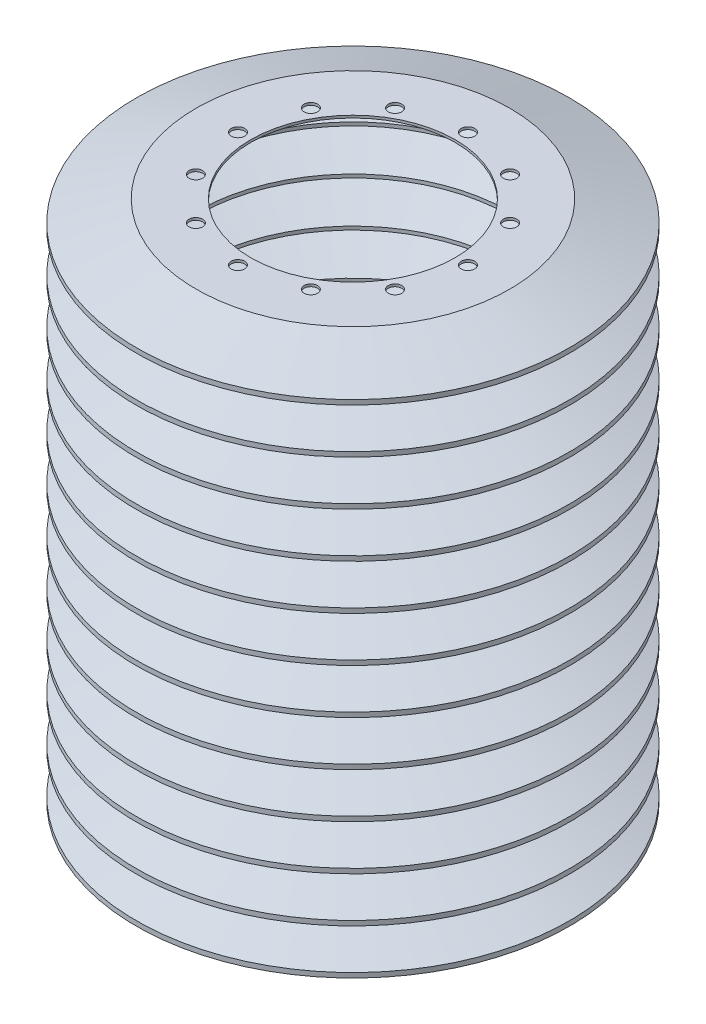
ISO-10303-21;
HEADER;
FILE_DESCRIPTION(('STEP AP214'),'2;1');
FILE_NAME('part.step','',(''),(''),'','','');
FILE_SCHEMA(('AUTOMOTIVE_DESIGN { 1 0 10303 214 1 1 1 1 }'));
ENDSEC;
DATA;
#1=APPLICATION_CONTEXT('core data for automotive mechanical design processes');
#2=APPLICATION_PROTOCOL_DEFINITION('international standard','automotive_design',2000,#1);
#3=PRODUCT_CONTEXT('',#1,'mechanical');
#4=PRODUCT('Part','Part','',(#3));
#5=PRODUCT_RELATED_PRODUCT_CATEGORY('part','',(#4));
#6=PRODUCT_DEFINITION_FORMATION('','',#4);
#7=PRODUCT_DEFINITION_CONTEXT('part definition',#1,'design');
#8=PRODUCT_DEFINITION('design','',#6,#7);
#9=PRODUCT_DEFINITION_SHAPE('','',#8);
#10=(LENGTH_UNIT() NAMED_UNIT(*) SI_UNIT(.MILLI.,.METRE.));
#11=(NAMED_UNIT(*) PLANE_ANGLE_UNIT() SI_UNIT($,.RADIAN.));
#12=(NAMED_UNIT(*) SI_UNIT($,.STERADIAN.) SOLID_ANGLE_UNIT());
#13=UNCERTAINTY_MEASURE_WITH_UNIT(LENGTH_MEASURE(1.E-05),#10,'distance_accuracy_value','');
#14=(GEOMETRIC_REPRESENTATION_CONTEXT(3) GLOBAL_UNCERTAINTY_ASSIGNED_CONTEXT((#13)) GLOBAL_UNIT_ASSIGNED_CONTEXT((#10,
#11,#12)) REPRESENTATION_CONTEXT('',''));
#15=CARTESIAN_POINT('',(0.,0.,0.));
#16=DIRECTION('',(0.,0.,1.));
#17=DIRECTION('',(1.,0.,0.));
#18=AXIS2_PLACEMENT_3D('',#15,#16,#17);
#19=CARTESIAN_POINT('',(-42.5,17.7051171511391,0.));
#20=DIRECTION('',(0.,1.,0.));
#21=DIRECTION('',(0.,0.,1.));
#22=AXIS2_PLACEMENT_3D('',#19,#20,#21);
#23=PLANE('',#22);
#24=CARTESIAN_POINT('',(41.3984391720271,17.7051171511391,-23.9013999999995));
#25=DIRECTION('',(0.,-1.,0.));
#26=DIRECTION('',(0.,0.,-1.));
#27=AXIS2_PLACEMENT_3D('',#24,#25,#26);
#28=CIRCLE('',#27,2.79999999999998);
#29=CARTESIAN_POINT('',(41.3984391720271,17.7051171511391,-26.7013999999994));
#30=VERTEX_POINT('',#29);
#31=EDGE_CURVE('E1065',#30,#30,#28,.T.);
#32=ORIENTED_EDGE('',*,*,#31,.F.);
#33=EDGE_LOOP('',(#32));
#34=FACE_BOUND('',#33,.T.);
#35=CARTESIAN_POINT('',(5.00707752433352E-13,17.7051171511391,-47.8028));
#36=DIRECTION('',(0.,-1.,0.));
#37=DIRECTION('',(0.,0.,-1.));
#38=AXIS2_PLACEMENT_3D('',#35,#36,#37);
#39=CIRCLE('',#38,2.79999999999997);
#40=CARTESIAN_POINT('',(5.00707752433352E-13,17.7051171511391,-50.6028));
#41=VERTEX_POINT('',#40);
#42=EDGE_CURVE('E326',#41,#41,#39,.T.);
#43=ORIENTED_EDGE('',*,*,#42,.F.);
#44=EDGE_LOOP('',(#43));
#45=FACE_BOUND('',#44,.T.);
#46=CARTESIAN_POINT('',(-23.9013999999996,17.7051171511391,-41.398439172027));
#47=DIRECTION('',(0.,-1.,0.));
#48=DIRECTION('',(0.,0.,-1.));
#49=AXIS2_PLACEMENT_3D('',#46,#47,#48);
#50=CIRCLE('',#49,2.79999999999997);
#51=CARTESIAN_POINT('',(-23.9013999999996,17.7051171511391,-44.198439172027));
#52=VERTEX_POINT('',#51);
#53=EDGE_CURVE('E323',#52,#52,#50,.T.);
#54=ORIENTED_EDGE('',*,*,#53,.F.);
#55=EDGE_LOOP('',(#54));
#56=FACE_BOUND('',#55,.T.);
#57=CARTESIAN_POINT('',(-47.8028,17.7051171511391,0.));
#58=DIRECTION('',(0.,-1.,0.));
#59=DIRECTION('',(0.,0.,-1.));
#60=AXIS2_PLACEMENT_3D('',#57,#58,#59);
#61=CIRCLE('',#60,2.79999999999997);
#62=CARTESIAN_POINT('',(-47.8028,17.7051171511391,-2.79999999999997));
#63=VERTEX_POINT('',#62);
#64=EDGE_CURVE('E356',#63,#63,#61,.T.);
#65=ORIENTED_EDGE('',*,*,#64,.F.);
#66=EDGE_LOOP('',(#65));
#67=FACE_BOUND('',#66,.T.);
#68=CARTESIAN_POINT('',(-41.3984391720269,17.7051171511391,23.9013999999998));
#69=DIRECTION('',(0.,-1.,0.));
#70=DIRECTION('',(0.,0.,-1.));
#71=AXIS2_PLACEMENT_3D('',#68,#69,#70);
#72=CIRCLE('',#71,2.79999999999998);
#73=CARTESIAN_POINT('',(-41.3984391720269,17.7051171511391,21.1013999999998));
#74=VERTEX_POINT('',#73);
#75=EDGE_CURVE('E365',#74,#74,#72,.T.);
#76=ORIENTED_EDGE('',*,*,#75,.F.);
#77=EDGE_LOOP('',(#76));
#78=FACE_BOUND('',#77,.T.);
#79=CARTESIAN_POINT('',(-23.9014000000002,17.7051171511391,41.3984391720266));
#80=DIRECTION('',(0.,-1.,0.));
#81=DIRECTION('',(0.,0.,-1.));
#82=AXIS2_PLACEMENT_3D('',#79,#80,#81);
#83=CIRCLE('',#82,2.79999999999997);
#84=CARTESIAN_POINT('',(-23.9014000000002,17.7051171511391,38.5984391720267));
#85=VERTEX_POINT('',#84);
#86=EDGE_CURVE('E377',#85,#85,#83,.T.);
#87=ORIENTED_EDGE('',*,*,#86,.F.);
#88=EDGE_LOOP('',(#87));
#89=FACE_BOUND('',#88,.T.);
#90=CARTESIAN_POINT('',(-1.66902584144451E-13,17.7051171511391,47.8028));
#91=DIRECTION('',(0.,-1.,0.));
#92=DIRECTION('',(0.,0.,-1.));
#93=AXIS2_PLACEMENT_3D('',#90,#91,#92);
#94=CIRCLE('',#93,2.79999999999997);
#95=CARTESIAN_POINT('',(-1.66902584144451E-13,17.7051171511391,45.0028));
#96=VERTEX_POINT('',#95);
#97=EDGE_CURVE('E389',#96,#96,#94,.T.);
#98=ORIENTED_EDGE('',*,*,#97,.F.);
#99=EDGE_LOOP('',(#98));
#100=FACE_BOUND('',#99,.T.);
#101=CARTESIAN_POINT('',(23.9013999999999,17.7051171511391,41.3984391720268));
#102=DIRECTION('',(0.,-1.,0.));
#103=DIRECTION('',(0.,0.,-1.));
#104=AXIS2_PLACEMENT_3D('',#101,#102,#103);
#105=CIRCLE('',#104,2.79999999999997);
#106=CARTESIAN_POINT('',(23.9013999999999,17.7051171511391,38.5984391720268));
#107=VERTEX_POINT('',#106);
#108=EDGE_CURVE('E401',#107,#107,#105,.T.);
#109=ORIENTED_EDGE('',*,*,#108,.F.);
#110=EDGE_LOOP('',(#109));
#111=FACE_BOUND('',#110,.T.);
#112=CARTESIAN_POINT('',(41.3984391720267,17.7051171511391,23.9014));
#113=DIRECTION('',(0.,-1.,0.));
#114=DIRECTION('',(0.,0.,-1.));
#115=AXIS2_PLACEMENT_3D('',#112,#113,#114);
#116=CIRCLE('',#115,2.79999999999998);
#117=CARTESIAN_POINT('',(41.3984391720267,17.7051171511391,21.1014000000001));
#118=VERTEX_POINT('',#117);
#119=EDGE_CURVE('E413',#118,#118,#116,.T.);
#120=ORIENTED_EDGE('',*,*,#119,.F.);
#121=EDGE_LOOP('',(#120));
#122=FACE_BOUND('',#121,.T.);
#123=CARTESIAN_POINT('',(47.8028,17.7051171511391,0.));
#124=DIRECTION('',(0.,-1.,0.));
#125=DIRECTION('',(0.,0.,-1.));
#126=AXIS2_PLACEMENT_3D('',#123,#124,#125);
#127=CIRCLE('',#126,2.79999999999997);
#128=CARTESIAN_POINT('',(47.8028,17.7051171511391,-2.79999999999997));
#129=VERTEX_POINT('',#128);
#130=EDGE_CURVE('E420',#129,#129,#127,.T.);
#131=ORIENTED_EDGE('',*,*,#130,.F.);
#132=EDGE_LOOP('',(#131));
#133=FACE_BOUND('',#132,.T.);
#134=CARTESIAN_POINT('',(0.,17.7051171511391,0.));
#135=DIRECTION('',(0.,-1.,0.));
#136=DIRECTION('',(0.,0.,-1.));
#137=AXIS2_PLACEMENT_3D('',#134,#135,#136);
#138=CIRCLE('',#137,42.5);
#139=CARTESIAN_POINT('',(0.,17.7051171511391,-42.5));
#140=VERTEX_POINT('',#139);
#141=EDGE_CURVE('E64',#140,#140,#138,.T.);
#142=ORIENTED_EDGE('',*,*,#141,.F.);
#143=EDGE_LOOP('',(#142));
#144=FACE_BOUND('',#143,.T.);
#145=CARTESIAN_POINT('',(0.,17.7051171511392,0.));
#146=DIRECTION('',(0.,-1.,0.));
#147=DIRECTION('',(0.,0.,-1.));
#148=AXIS2_PLACEMENT_3D('',#145,#146,#147);
#149=CIRCLE('',#148,65.1724702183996);
#150=CARTESIAN_POINT('',(0.,17.7051171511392,-65.1724702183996));
#151=VERTEX_POINT('',#150);
#152=EDGE_CURVE('E67',#151,#151,#149,.T.);
#153=ORIENTED_EDGE('',*,*,#152,.T.);
#154=EDGE_LOOP('',(#153));
#155=FACE_BOUND('',#154,.T.);
#156=CARTESIAN_POINT('',(-41.3984391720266,17.7051171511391,-23.9014000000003));
#157=DIRECTION('',(0.,-1.,0.));
#158=DIRECTION('',(0.,0.,-1.));
#159=AXIS2_PLACEMENT_3D('',#156,#157,#158);
#160=CIRCLE('',#159,2.79999999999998);
#161=CARTESIAN_POINT('',(-41.3984391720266,17.7051171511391,-26.7014000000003));
#162=VERTEX_POINT('',#161);
#163=EDGE_CURVE('E348',#162,#162,#160,.T.);
#164=ORIENTED_EDGE('',*,*,#163,.F.);
#165=EDGE_LOOP('',(#164));
#166=FACE_BOUND('',#165,.T.);
#167=CARTESIAN_POINT('',(23.9014000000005,17.7051171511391,-41.3984391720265));
#168=DIRECTION('',(0.,-1.,0.));
#169=DIRECTION('',(0.,0.,-1.));
#170=AXIS2_PLACEMENT_3D('',#167,#168,#169);
#171=CIRCLE('',#170,2.79999999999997);
#172=CARTESIAN_POINT('',(23.9014000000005,17.7051171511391,-44.1984391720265));
#173=VERTEX_POINT('',#172);
#174=EDGE_CURVE('E822',#173,#173,#171,.T.);
#175=ORIENTED_EDGE('',*,*,#174,.F.);
#176=EDGE_LOOP('',(#175));
#177=FACE_BOUND('',#176,.T.);
#178=ADVANCED_FACE('F36',(#34,#45,#56,#67,#78,#89,#100,#111,#122,#133,#144,#155,#166,#177),#23,.F.);
#179=CARTESIAN_POINT('',(0.,0.,0.));
#180=DIRECTION('',(0.,-1.,0.));
#181=DIRECTION('',(0.,0.,-1.));
#182=AXIS2_PLACEMENT_3D('',#179,#180,#181);
#183=CYLINDRICAL_SURFACE('',#182,65.);
#184=CARTESIAN_POINT('',(0.,242.278882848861,0.));
#185=DIRECTION('',(0.,-1.,0.));
#186=DIRECTION('',(0.,0.,-1.));
#187=AXIS2_PLACEMENT_3D('',#184,#185,#186);
#188=CIRCLE('',#187,65.);
#189=CARTESIAN_POINT('',(0.,242.278882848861,-65.));
#190=VERTEX_POINT('',#189);
#191=EDGE_CURVE('E115',#190,#190,#188,.T.);
#192=ORIENTED_EDGE('',*,*,#191,.T.);
#193=EDGE_LOOP('',(#192));
#194=FACE_BOUND('',#193,.T.);
#195=CARTESIAN_POINT('',(0.,242.375989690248,0.));
#196=DIRECTION('',(0.,1.,0.));
#197=DIRECTION('',(0.,0.,1.));
#198=AXIS2_PLACEMENT_3D('',#195,#196,#197);
#199=CIRCLE('',#198,65.);
#200=CARTESIAN_POINT('',(0.,242.375989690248,65.));
#201=VERTEX_POINT('',#200);
#202=EDGE_CURVE('E10',#201,#201,#199,.F.);
#203=ORIENTED_EDGE('',*,*,#202,.F.);
#204=EDGE_LOOP('',(#203));
#205=FACE_BOUND('',#204,.T.);
#206=ADVANCED_FACE('F468',(#194,#205),#183,.F.);
#207=CARTESIAN_POINT('',(0.,158.625,0.));
#208=DIRECTION('',(0.,-1.,0.));
#209=DIRECTION('',(0.,0.,-1.));
#210=AXIS2_PLACEMENT_3D('',#207,#208,#209);
#211=CONICAL_SURFACE('',#210,89.7549423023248,1.23449391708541);
#212=CARTESIAN_POINT('',(0.,167.278882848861,0.));
#213=DIRECTION('',(0.,-1.,0.));
#214=DIRECTION('',(0.,0.,-1.));
#215=AXIS2_PLACEMENT_3D('',#212,#213,#214);
#216=CIRCLE('',#215,65.);
#217=CARTESIAN_POINT('',(0.,167.278882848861,-65.));
#218=VERTEX_POINT('',#217);
#219=EDGE_CURVE('E70',#218,#218,#216,.T.);
#220=ORIENTED_EDGE('',*,*,#219,.F.);
#221=EDGE_LOOP('',(#220));
#222=FACE_BOUND('',#221,.T.);
#223=CARTESIAN_POINT('',(0.,158.625,0.));
#224=DIRECTION('',(0.,-1.,0.));
#225=DIRECTION('',(0.,0.,-1.));
#226=AXIS2_PLACEMENT_3D('',#223,#224,#225);
#227=CIRCLE('',#226,89.7549423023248);
#228=CARTESIAN_POINT('',(0.,158.625,-89.7549423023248));
#229=VERTEX_POINT('',#228);
#230=EDGE_CURVE('E45',#229,#229,#227,.T.);
#231=ORIENTED_EDGE('',*,*,#230,.T.);
#232=EDGE_LOOP('',(#231));
#233=FACE_BOUND('',#232,.T.);
#234=ADVANCED_FACE('F38',(#222,#233),#211,.F.);
#235=CARTESIAN_POINT('',(0.,149.971117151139,0.));
#236=DIRECTION('',(0.,1.,0.));
#237=DIRECTION('',(0.,0.,1.));
#238=AXIS2_PLACEMENT_3D('',#235,#236,#237);
#239=CONICAL_SURFACE('',#238,65.,1.23449391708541);
#240=ORIENTED_EDGE('',*,*,#230,.F.);
#241=EDGE_LOOP('',(#240));
#242=FACE_BOUND('',#241,.T.);
#243=CARTESIAN_POINT('',(0.,149.971117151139,0.));
#244=DIRECTION('',(0.,-1.,0.));
#245=DIRECTION('',(0.,0.,-1.));
#246=AXIS2_PLACEMENT_3D('',#243,#244,#245);
#247=CIRCLE('',#246,65.);
#248=CARTESIAN_POINT('',(0.,149.971117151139,-65.));
#249=VERTEX_POINT('',#248);
#250=EDGE_CURVE('E52',#249,#249,#247,.T.);
#251=ORIENTED_EDGE('',*,*,#250,.T.);
#252=EDGE_LOOP('',(#251));
#253=FACE_BOUND('',#252,.T.);
#254=ADVANCED_FACE('F754',(#242,#253),#239,.F.);
#255=CARTESIAN_POINT('',(0.,0.,0.));
#256=DIRECTION('',(0.,-1.,0.));
#257=DIRECTION('',(0.,0.,-1.));
#258=AXIS2_PLACEMENT_3D('',#255,#256,#257);
#259=CYLINDRICAL_SURFACE('',#258,65.);
#260=ORIENTED_EDGE('',*,*,#250,.F.);
#261=EDGE_LOOP('',(#260));
#262=FACE_BOUND('',#261,.T.);
#263=CARTESIAN_POINT('',(0.,148.528882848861,0.));
#264=DIRECTION('',(0.,-1.,0.));
#265=DIRECTION('',(0.,0.,-1.));
#266=AXIS2_PLACEMENT_3D('',#263,#264,#265);
#267=CIRCLE('',#266,65.);
#268=CARTESIAN_POINT('',(0.,148.528882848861,-65.));
#269=VERTEX_POINT('',#268);
#270=EDGE_CURVE('E294',#269,#269,#267,.T.);
#271=ORIENTED_EDGE('',*,*,#270,.T.);
#272=EDGE_LOOP('',(#271));
#273=FACE_BOUND('',#272,.T.);
#274=ADVANCED_FACE('F751',(#262,#273),#259,.F.);
#275=CARTESIAN_POINT('',(0.,139.875,0.));
#276=DIRECTION('',(0.,-1.,0.));
#277=DIRECTION('',(0.,0.,-1.));
#278=AXIS2_PLACEMENT_3D('',#275,#276,#277);
#279=CONICAL_SURFACE('',#278,89.7549423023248,1.23449391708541);
#280=ORIENTED_EDGE('',*,*,#270,.F.);
#281=EDGE_LOOP('',(#280));
#282=FACE_BOUND('',#281,.T.);
#283=CARTESIAN_POINT('',(0.,139.875,0.));
#284=DIRECTION('',(0.,-1.,0.));
#285=DIRECTION('',(0.,0.,-1.));
#286=AXIS2_PLACEMENT_3D('',#283,#284,#285);
#287=CIRCLE('',#286,89.7549423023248);
#288=CARTESIAN_POINT('',(0.,139.875,-89.7549423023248));
#289=VERTEX_POINT('',#288);
#290=EDGE_CURVE('E290',#289,#289,#287,.T.);
#291=ORIENTED_EDGE('',*,*,#290,.T.);
#292=EDGE_LOOP('',(#291));
#293=FACE_BOUND('',#292,.T.);
#294=ADVANCED_FACE('F747',(#282,#293),#279,.F.);
#295=CARTESIAN_POINT('',(0.,131.221117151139,0.));
#296=DIRECTION('',(0.,1.,0.));
#297=DIRECTION('',(0.,0.,1.));
#298=AXIS2_PLACEMENT_3D('',#295,#296,#297);
#299=CONICAL_SURFACE('',#298,65.,1.23449391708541);
#300=ORIENTED_EDGE('',*,*,#290,.F.);
#301=EDGE_LOOP('',(#300));
#302=FACE_BOUND('',#301,.T.);
#303=CARTESIAN_POINT('',(0.,131.221117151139,0.));
#304=DIRECTION('',(0.,-1.,0.));
#305=DIRECTION('',(0.,0.,-1.));
#306=AXIS2_PLACEMENT_3D('',#303,#304,#305);
#307=CIRCLE('',#306,65.);
#308=CARTESIAN_POINT('',(0.,131.221117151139,-65.));
#309=VERTEX_POINT('',#308);
#310=EDGE_CURVE('E287',#309,#309,#307,.T.);
#311=ORIENTED_EDGE('',*,*,#310,.T.);
#312=EDGE_LOOP('',(#311));
#313=FACE_BOUND('',#312,.T.);
#314=ADVANCED_FACE('F743',(#302,#313),#299,.F.);
#315=CARTESIAN_POINT('',(0.,0.,0.));
#316=DIRECTION('',(0.,-1.,0.));
#317=DIRECTION('',(0.,0.,-1.));
#318=AXIS2_PLACEMENT_3D('',#315,#316,#317);
#319=CYLINDRICAL_SURFACE('',#318,65.);
#320=ORIENTED_EDGE('',*,*,#310,.F.);
#321=EDGE_LOOP('',(#320));
#322=FACE_BOUND('',#321,.T.);
#323=CARTESIAN_POINT('',(0.,129.778882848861,0.));
#324=DIRECTION('',(0.,-1.,0.));
#325=DIRECTION('',(0.,0.,-1.));
#326=AXIS2_PLACEMENT_3D('',#323,#324,#325);
#327=CIRCLE('',#326,65.);
#328=CARTESIAN_POINT('',(0.,129.778882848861,-65.));
#329=VERTEX_POINT('',#328);
#330=EDGE_CURVE('E284',#329,#329,#327,.T.);
#331=ORIENTED_EDGE('',*,*,#330,.T.);
#332=EDGE_LOOP('',(#331));
#333=FACE_BOUND('',#332,.T.);
#334=ADVANCED_FACE('F739',(#322,#333),#319,.F.);
#335=CARTESIAN_POINT('',(0.,121.125,0.));
#336=DIRECTION('',(0.,-1.,0.));
#337=DIRECTION('',(0.,0.,-1.));
#338=AXIS2_PLACEMENT_3D('',#335,#336,#337);
#339=CONICAL_SURFACE('',#338,89.7549423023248,1.23449391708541);
#340=ORIENTED_EDGE('',*,*,#330,.F.);
#341=EDGE_LOOP('',(#340));
#342=FACE_BOUND('',#341,.T.);
#343=CARTESIAN_POINT('',(0.,121.125,0.));
#344=DIRECTION('',(0.,-1.,0.));
#345=DIRECTION('',(0.,0.,-1.));
#346=AXIS2_PLACEMENT_3D('',#343,#344,#345);
#347=CIRCLE('',#346,89.7549423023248);
#348=CARTESIAN_POINT('',(0.,121.125,-89.7549423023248));
#349=VERTEX_POINT('',#348);
#350=EDGE_CURVE('E281',#349,#349,#347,.T.);
#351=ORIENTED_EDGE('',*,*,#350,.T.);
#352=EDGE_LOOP('',(#351));
#353=FACE_BOUND('',#352,.T.);
#354=ADVANCED_FACE('F735',(#342,#353),#339,.F.);
#355=CARTESIAN_POINT('',(0.,112.471117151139,0.));
#356=DIRECTION('',(0.,1.,0.));
#357=DIRECTION('',(0.,0.,1.));
#358=AXIS2_PLACEMENT_3D('',#355,#356,#357);
#359=CONICAL_SURFACE('',#358,65.,1.23449391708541);
#360=ORIENTED_EDGE('',*,*,#350,.F.);
#361=EDGE_LOOP('',(#360));
#362=FACE_BOUND('',#361,.T.);
#363=CARTESIAN_POINT('',(0.,112.471117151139,0.));
#364=DIRECTION('',(0.,-1.,0.));
#365=DIRECTION('',(0.,0.,-1.));
#366=AXIS2_PLACEMENT_3D('',#363,#364,#365);
#367=CIRCLE('',#366,65.);
#368=CARTESIAN_POINT('',(0.,112.471117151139,-65.));
#369=VERTEX_POINT('',#368);
#370=EDGE_CURVE('E278',#369,#369,#367,.T.);
#371=ORIENTED_EDGE('',*,*,#370,.T.);
#372=EDGE_LOOP('',(#371));
#373=FACE_BOUND('',#372,.T.);
#374=ADVANCED_FACE('F731',(#362,#373),#359,.F.);
#375=CARTESIAN_POINT('',(0.,0.,0.));
#376=DIRECTION('',(0.,-1.,0.));
#377=DIRECTION('',(0.,0.,-1.));
#378=AXIS2_PLACEMENT_3D('',#375,#376,#377);
#379=CYLINDRICAL_SURFACE('',#378,65.);
#380=ORIENTED_EDGE('',*,*,#370,.F.);
#381=EDGE_LOOP('',(#380));
#382=FACE_BOUND('',#381,.T.);
#383=CARTESIAN_POINT('',(0.,111.028882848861,0.));
#384=DIRECTION('',(0.,-1.,0.));
#385=DIRECTION('',(0.,0.,-1.));
#386=AXIS2_PLACEMENT_3D('',#383,#384,#385);
#387=CIRCLE('',#386,65.);
#388=CARTESIAN_POINT('',(0.,111.028882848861,-65.));
#389=VERTEX_POINT('',#388);
#390=EDGE_CURVE('E275',#389,#389,#387,.T.);
#391=ORIENTED_EDGE('',*,*,#390,.T.);
#392=EDGE_LOOP('',(#391));
#393=FACE_BOUND('',#392,.T.);
#394=ADVANCED_FACE('F727',(#382,#393),#379,.F.);
#395=CARTESIAN_POINT('',(0.,102.375,0.));
#396=DIRECTION('',(0.,-1.,0.));
#397=DIRECTION('',(0.,0.,-1.));
#398=AXIS2_PLACEMENT_3D('',#395,#396,#397);
#399=CONICAL_SURFACE('',#398,89.7549423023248,1.23449391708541);
#400=ORIENTED_EDGE('',*,*,#390,.F.);
#401=EDGE_LOOP('',(#400));
#402=FACE_BOUND('',#401,.T.);
#403=CARTESIAN_POINT('',(0.,102.375,0.));
#404=DIRECTION('',(0.,-1.,0.));
#405=DIRECTION('',(0.,0.,-1.));
#406=AXIS2_PLACEMENT_3D('',#403,#404,#405);
#407=CIRCLE('',#406,89.7549423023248);
#408=CARTESIAN_POINT('',(0.,102.375,-89.7549423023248));
#409=VERTEX_POINT('',#408);
#410=EDGE_CURVE('E272',#409,#409,#407,.T.);
#411=ORIENTED_EDGE('',*,*,#410,.T.);
#412=EDGE_LOOP('',(#411));
#413=FACE_BOUND('',#412,.T.);
#414=ADVANCED_FACE('F723',(#402,#413),#399,.F.);
#415=CARTESIAN_POINT('',(0.,93.7211171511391,0.));
#416=DIRECTION('',(0.,1.,0.));
#417=DIRECTION('',(0.,0.,1.));
#418=AXIS2_PLACEMENT_3D('',#415,#416,#417);
#419=CONICAL_SURFACE('',#418,65.,1.23449391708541);
#420=ORIENTED_EDGE('',*,*,#410,.F.);
#421=EDGE_LOOP('',(#420));
#422=FACE_BOUND('',#421,.T.);
#423=CARTESIAN_POINT('',(0.,93.7211171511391,0.));
#424=DIRECTION('',(0.,-1.,0.));
#425=DIRECTION('',(0.,0.,-1.));
#426=AXIS2_PLACEMENT_3D('',#423,#424,#425);
#427=CIRCLE('',#426,65.);
#428=CARTESIAN_POINT('',(0.,93.7211171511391,-65.));
#429=VERTEX_POINT('',#428);
#430=EDGE_CURVE('E269',#429,#429,#427,.T.);
#431=ORIENTED_EDGE('',*,*,#430,.T.);
#432=EDGE_LOOP('',(#431));
#433=FACE_BOUND('',#432,.T.);
#434=ADVANCED_FACE('F719',(#422,#433),#419,.F.);
#435=CARTESIAN_POINT('',(0.,0.,0.));
#436=DIRECTION('',(0.,-1.,0.));
#437=DIRECTION('',(0.,0.,-1.));
#438=AXIS2_PLACEMENT_3D('',#435,#436,#437);
#439=CYLINDRICAL_SURFACE('',#438,65.);
#440=ORIENTED_EDGE('',*,*,#430,.F.);
#441=EDGE_LOOP('',(#440));
#442=FACE_BOUND('',#441,.T.);
#443=CARTESIAN_POINT('',(0.,92.2788828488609,0.));
#444=DIRECTION('',(0.,-1.,0.));
#445=DIRECTION('',(0.,0.,-1.));
#446=AXIS2_PLACEMENT_3D('',#443,#444,#445);
#447=CIRCLE('',#446,65.);
#448=CARTESIAN_POINT('',(0.,92.2788828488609,-65.));
#449=VERTEX_POINT('',#448);
#450=EDGE_CURVE('E266',#449,#449,#447,.T.);
#451=ORIENTED_EDGE('',*,*,#450,.T.);
#452=EDGE_LOOP('',(#451));
#453=FACE_BOUND('',#452,.T.);
#454=ADVANCED_FACE('F715',(#442,#453),#439,.F.);
#455=CARTESIAN_POINT('',(0.,83.625,0.));
#456=DIRECTION('',(0.,-1.,0.));
#457=DIRECTION('',(0.,0.,-1.));
#458=AXIS2_PLACEMENT_3D('',#455,#456,#457);
#459=CONICAL_SURFACE('',#458,89.7549423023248,1.23449391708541);
#460=ORIENTED_EDGE('',*,*,#450,.F.);
#461=EDGE_LOOP('',(#460));
#462=FACE_BOUND('',#461,.T.);
#463=CARTESIAN_POINT('',(0.,83.625,0.));
#464=DIRECTION('',(0.,-1.,0.));
#465=DIRECTION('',(0.,0.,-1.));
#466=AXIS2_PLACEMENT_3D('',#463,#464,#465);
#467=CIRCLE('',#466,89.7549423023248);
#468=CARTESIAN_POINT('',(0.,83.625,-89.7549423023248));
#469=VERTEX_POINT('',#468);
#470=EDGE_CURVE('E263',#469,#469,#467,.T.);
#471=ORIENTED_EDGE('',*,*,#470,.T.);
#472=EDGE_LOOP('',(#471));
#473=FACE_BOUND('',#472,.T.);
#474=ADVANCED_FACE('F711',(#462,#473),#459,.F.);
#475=CARTESIAN_POINT('',(0.,74.9711171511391,0.));
#476=DIRECTION('',(0.,1.,0.));
#477=DIRECTION('',(0.,0.,1.));
#478=AXIS2_PLACEMENT_3D('',#475,#476,#477);
#479=CONICAL_SURFACE('',#478,65.,1.23449391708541);
#480=ORIENTED_EDGE('',*,*,#470,.F.);
#481=EDGE_LOOP('',(#480));
#482=FACE_BOUND('',#481,.T.);
#483=CARTESIAN_POINT('',(0.,74.9711171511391,0.));
#484=DIRECTION('',(0.,-1.,0.));
#485=DIRECTION('',(0.,0.,-1.));
#486=AXIS2_PLACEMENT_3D('',#483,#484,#485);
#487=CIRCLE('',#486,65.);
#488=CARTESIAN_POINT('',(0.,74.9711171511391,-65.));
#489=VERTEX_POINT('',#488);
#490=EDGE_CURVE('E260',#489,#489,#487,.T.);
#491=ORIENTED_EDGE('',*,*,#490,.T.);
#492=EDGE_LOOP('',(#491));
#493=FACE_BOUND('',#492,.T.);
#494=ADVANCED_FACE('F707',(#482,#493),#479,.F.);
#495=CARTESIAN_POINT('',(0.,0.,0.));
#496=DIRECTION('',(0.,-1.,0.));
#497=DIRECTION('',(0.,0.,-1.));
#498=AXIS2_PLACEMENT_3D('',#495,#496,#497);
#499=CYLINDRICAL_SURFACE('',#498,65.);
#500=ORIENTED_EDGE('',*,*,#490,.F.);
#501=EDGE_LOOP('',(#500));
#502=FACE_BOUND('',#501,.T.);
#503=CARTESIAN_POINT('',(0.,73.5288828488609,0.));
#504=DIRECTION('',(0.,-1.,0.));
#505=DIRECTION('',(0.,0.,-1.));
#506=AXIS2_PLACEMENT_3D('',#503,#504,#505);
#507=CIRCLE('',#506,65.);
#508=CARTESIAN_POINT('',(0.,73.5288828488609,-65.));
#509=VERTEX_POINT('',#508);
#510=EDGE_CURVE('E257',#509,#509,#507,.T.);
#511=ORIENTED_EDGE('',*,*,#510,.T.);
#512=EDGE_LOOP('',(#511));
#513=FACE_BOUND('',#512,.T.);
#514=ADVANCED_FACE('F703',(#502,#513),#499,.F.);
#515=CARTESIAN_POINT('',(0.,64.875,0.));
#516=DIRECTION('',(0.,-1.,0.));
#517=DIRECTION('',(0.,0.,-1.));
#518=AXIS2_PLACEMENT_3D('',#515,#516,#517);
#519=CONICAL_SURFACE('',#518,89.7549423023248,1.23449391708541);
#520=ORIENTED_EDGE('',*,*,#510,.F.);
#521=EDGE_LOOP('',(#520));
#522=FACE_BOUND('',#521,.T.);
#523=CARTESIAN_POINT('',(0.,64.875,0.));
#524=DIRECTION('',(0.,-1.,0.));
#525=DIRECTION('',(0.,0.,-1.));
#526=AXIS2_PLACEMENT_3D('',#523,#524,#525);
#527=CIRCLE('',#526,89.7549423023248);
#528=CARTESIAN_POINT('',(0.,64.875,-89.7549423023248));
#529=VERTEX_POINT('',#528);
#530=EDGE_CURVE('E254',#529,#529,#527,.T.);
#531=ORIENTED_EDGE('',*,*,#530,.T.);
#532=EDGE_LOOP('',(#531));
#533=FACE_BOUND('',#532,.T.);
#534=ADVANCED_FACE('F699',(#522,#533),#519,.F.);
#535=CARTESIAN_POINT('',(0.,56.2211171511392,0.));
#536=DIRECTION('',(0.,1.,0.));
#537=DIRECTION('',(0.,0.,1.));
#538=AXIS2_PLACEMENT_3D('',#535,#536,#537);
#539=CONICAL_SURFACE('',#538,65.,1.23449391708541);
#540=ORIENTED_EDGE('',*,*,#530,.F.);
#541=EDGE_LOOP('',(#540));
#542=FACE_BOUND('',#541,.T.);
#543=CARTESIAN_POINT('',(0.,56.2211171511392,0.));
#544=DIRECTION('',(0.,-1.,0.));
#545=DIRECTION('',(0.,0.,-1.));
#546=AXIS2_PLACEMENT_3D('',#543,#544,#545);
#547=CIRCLE('',#546,65.);
#548=CARTESIAN_POINT('',(0.,56.2211171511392,-65.));
#549=VERTEX_POINT('',#548);
#550=EDGE_CURVE('E251',#549,#549,#547,.T.);
#551=ORIENTED_EDGE('',*,*,#550,.T.);
#552=EDGE_LOOP('',(#551));
#553=FACE_BOUND('',#552,.T.);
#554=ADVANCED_FACE('F695',(#542,#553),#539,.F.);
#555=CARTESIAN_POINT('',(0.,0.,0.));
#556=DIRECTION('',(0.,-1.,0.));
#557=DIRECTION('',(0.,0.,-1.));
#558=AXIS2_PLACEMENT_3D('',#555,#556,#557);
#559=CYLINDRICAL_SURFACE('',#558,65.);
#560=ORIENTED_EDGE('',*,*,#550,.F.);
#561=EDGE_LOOP('',(#560));
#562=FACE_BOUND('',#561,.T.);
#563=CARTESIAN_POINT('',(0.,54.7788828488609,0.));
#564=DIRECTION('',(0.,-1.,0.));
#565=DIRECTION('',(0.,0.,-1.));
#566=AXIS2_PLACEMENT_3D('',#563,#564,#565);
#567=CIRCLE('',#566,65.);
#568=CARTESIAN_POINT('',(0.,54.7788828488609,-65.));
#569=VERTEX_POINT('',#568);
#570=EDGE_CURVE('E248',#569,#569,#567,.T.);
#571=ORIENTED_EDGE('',*,*,#570,.T.);
#572=EDGE_LOOP('',(#571));
#573=FACE_BOUND('',#572,.T.);
#574=ADVANCED_FACE('F691',(#562,#573),#559,.F.);
#575=CARTESIAN_POINT('',(0.,46.125,0.));
#576=DIRECTION('',(0.,-1.,0.));
#577=DIRECTION('',(0.,0.,-1.));
#578=AXIS2_PLACEMENT_3D('',#575,#576,#577);
#579=CONICAL_SURFACE('',#578,89.7549423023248,1.23449391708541);
#580=ORIENTED_EDGE('',*,*,#570,.F.);
#581=EDGE_LOOP('',(#580));
#582=FACE_BOUND('',#581,.T.);
#583=CARTESIAN_POINT('',(0.,46.125,0.));
#584=DIRECTION('',(0.,-1.,0.));
#585=DIRECTION('',(0.,0.,-1.));
#586=AXIS2_PLACEMENT_3D('',#583,#584,#585);
#587=CIRCLE('',#586,89.7549423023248);
#588=CARTESIAN_POINT('',(0.,46.125,-89.7549423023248));
#589=VERTEX_POINT('',#588);
#590=EDGE_CURVE('E245',#589,#589,#587,.T.);
#591=ORIENTED_EDGE('',*,*,#590,.T.);
#592=EDGE_LOOP('',(#591));
#593=FACE_BOUND('',#592,.T.);
#594=ADVANCED_FACE('F687',(#582,#593),#579,.F.);
#595=CARTESIAN_POINT('',(0.,37.4711171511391,0.));
#596=DIRECTION('',(0.,1.,0.));
#597=DIRECTION('',(0.,0.,1.));
#598=AXIS2_PLACEMENT_3D('',#595,#596,#597);
#599=CONICAL_SURFACE('',#598,65.,1.23449391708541);
#600=ORIENTED_EDGE('',*,*,#590,.F.);
#601=EDGE_LOOP('',(#600));
#602=FACE_BOUND('',#601,.T.);
#603=CARTESIAN_POINT('',(0.,37.4711171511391,0.));
#604=DIRECTION('',(0.,-1.,0.));
#605=DIRECTION('',(0.,0.,-1.));
#606=AXIS2_PLACEMENT_3D('',#603,#604,#605);
#607=CIRCLE('',#606,65.);
#608=CARTESIAN_POINT('',(0.,37.4711171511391,-65.));
#609=VERTEX_POINT('',#608);
#610=EDGE_CURVE('E242',#609,#609,#607,.T.);
#611=ORIENTED_EDGE('',*,*,#610,.T.);
#612=EDGE_LOOP('',(#611));
#613=FACE_BOUND('',#612,.T.);
#614=ADVANCED_FACE('F683',(#602,#613),#599,.F.);
#615=CARTESIAN_POINT('',(0.,0.,0.));
#616=DIRECTION('',(0.,-1.,0.));
#617=DIRECTION('',(0.,0.,-1.));
#618=AXIS2_PLACEMENT_3D('',#615,#616,#617);
#619=CYLINDRICAL_SURFACE('',#618,65.);
#620=ORIENTED_EDGE('',*,*,#610,.F.);
#621=EDGE_LOOP('',(#620));
#622=FACE_BOUND('',#621,.T.);
#623=CARTESIAN_POINT('',(0.,36.0288828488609,0.));
#624=DIRECTION('',(0.,-1.,0.));
#625=DIRECTION('',(0.,0.,-1.));
#626=AXIS2_PLACEMENT_3D('',#623,#624,#625);
#627=CIRCLE('',#626,65.);
#628=CARTESIAN_POINT('',(0.,36.0288828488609,-65.));
#629=VERTEX_POINT('',#628);
#630=EDGE_CURVE('E239',#629,#629,#627,.T.);
#631=ORIENTED_EDGE('',*,*,#630,.T.);
#632=EDGE_LOOP('',(#631));
#633=FACE_BOUND('',#632,.T.);
#634=ADVANCED_FACE('F679',(#622,#633),#619,.F.);
#635=CARTESIAN_POINT('',(0.,27.375,0.));
#636=DIRECTION('',(0.,-1.,0.));
#637=DIRECTION('',(0.,0.,-1.));
#638=AXIS2_PLACEMENT_3D('',#635,#636,#637);
#639=CONICAL_SURFACE('',#638,89.7549423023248,1.23449391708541);
#640=ORIENTED_EDGE('',*,*,#630,.F.);
#641=EDGE_LOOP('',(#640));
#642=FACE_BOUND('',#641,.T.);
#643=CARTESIAN_POINT('',(0.,27.375,0.));
#644=DIRECTION('',(0.,-1.,0.));
#645=DIRECTION('',(0.,0.,-1.));
#646=AXIS2_PLACEMENT_3D('',#643,#644,#645);
#647=CIRCLE('',#646,89.7549423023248);
#648=CARTESIAN_POINT('',(0.,27.375,-89.7549423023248));
#649=VERTEX_POINT('',#648);
#650=EDGE_CURVE('E236',#649,#649,#647,.T.);
#651=ORIENTED_EDGE('',*,*,#650,.T.);
#652=EDGE_LOOP('',(#651));
#653=FACE_BOUND('',#652,.T.);
#654=ADVANCED_FACE('F675',(#642,#653),#639,.F.);
#655=CARTESIAN_POINT('',(0.,18.7211171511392,0.));
#656=DIRECTION('',(0.,1.,0.));
#657=DIRECTION('',(0.,0.,1.));
#658=AXIS2_PLACEMENT_3D('',#655,#656,#657);
#659=CONICAL_SURFACE('',#658,65.,1.23449391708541);
#660=ORIENTED_EDGE('',*,*,#650,.F.);
#661=EDGE_LOOP('',(#660));
#662=FACE_BOUND('',#661,.T.);
#663=CARTESIAN_POINT('',(0.,18.7211171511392,0.));
#664=DIRECTION('',(0.,-1.,0.));
#665=DIRECTION('',(0.,0.,-1.));
#666=AXIS2_PLACEMENT_3D('',#663,#664,#665);
#667=CIRCLE('',#666,65.);
#668=CARTESIAN_POINT('',(0.,18.7211171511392,-65.));
#669=VERTEX_POINT('',#668);
#670=EDGE_CURVE('E58',#669,#669,#667,.T.);
#671=ORIENTED_EDGE('',*,*,#670,.T.);
#672=EDGE_LOOP('',(#671));
#673=FACE_BOUND('',#672,.T.);
#674=ADVANCED_FACE('F527',(#662,#673),#659,.F.);
#675=CARTESIAN_POINT('',(0.,233.625,0.));
#676=DIRECTION('',(0.,-1.,0.));
#677=DIRECTION('',(0.,0.,-1.));
#678=AXIS2_PLACEMENT_3D('',#675,#676,#677);
#679=CONICAL_SURFACE('',#678,89.7549423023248,1.23449391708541);
#680=ORIENTED_EDGE('',*,*,#191,.F.);
#681=EDGE_LOOP('',(#680));
#682=FACE_BOUND('',#681,.T.);
#683=CARTESIAN_POINT('',(0.,233.625,0.));
#684=DIRECTION('',(0.,-1.,0.));
#685=DIRECTION('',(0.,0.,-1.));
#686=AXIS2_PLACEMENT_3D('',#683,#684,#685);
#687=CIRCLE('',#686,89.7549423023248);
#688=CARTESIAN_POINT('',(0.,233.625,-89.7549423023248));
#689=VERTEX_POINT('',#688);
#690=EDGE_CURVE('E111',#689,#689,#687,.T.);
#691=ORIENTED_EDGE('',*,*,#690,.T.);
#692=EDGE_LOOP('',(#691));
#693=FACE_BOUND('',#692,.T.);
#694=ADVANCED_FACE('F524',(#682,#693),#679,.F.);
#695=CARTESIAN_POINT('',(0.,224.971117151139,0.));
#696=DIRECTION('',(0.,1.,0.));
#697=DIRECTION('',(0.,0.,1.));
#698=AXIS2_PLACEMENT_3D('',#695,#696,#697);
#699=CONICAL_SURFACE('',#698,65.,1.23449391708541);
#700=ORIENTED_EDGE('',*,*,#690,.F.);
#701=EDGE_LOOP('',(#700));
#702=FACE_BOUND('',#701,.T.);
#703=CARTESIAN_POINT('',(0.,224.971117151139,0.));
#704=DIRECTION('',(0.,-1.,0.));
#705=DIRECTION('',(0.,0.,-1.));
#706=AXIS2_PLACEMENT_3D('',#703,#704,#705);
#707=CIRCLE('',#706,65.);
#708=CARTESIAN_POINT('',(0.,224.971117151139,-65.));
#709=VERTEX_POINT('',#708);
#710=EDGE_CURVE('E107',#709,#709,#707,.T.);
#711=ORIENTED_EDGE('',*,*,#710,.T.);
#712=EDGE_LOOP('',(#711));
#713=FACE_BOUND('',#712,.T.);
#714=ADVANCED_FACE('F520',(#702,#713),#699,.F.);
#715=CARTESIAN_POINT('',(0.,0.,0.));
#716=DIRECTION('',(0.,-1.,0.));
#717=DIRECTION('',(0.,0.,-1.));
#718=AXIS2_PLACEMENT_3D('',#715,#716,#717);
#719=CYLINDRICAL_SURFACE('',#718,65.);
#720=ORIENTED_EDGE('',*,*,#710,.F.);
#721=EDGE_LOOP('',(#720));
#722=FACE_BOUND('',#721,.T.);
#723=CARTESIAN_POINT('',(0.,223.528882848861,0.));
#724=DIRECTION('',(0.,-1.,0.));
#725=DIRECTION('',(0.,0.,-1.));
#726=AXIS2_PLACEMENT_3D('',#723,#724,#725);
#727=CIRCLE('',#726,65.);
#728=CARTESIAN_POINT('',(0.,223.528882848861,-65.));
#729=VERTEX_POINT('',#728);
#730=EDGE_CURVE('E103',#729,#729,#727,.T.);
#731=ORIENTED_EDGE('',*,*,#730,.T.);
#732=EDGE_LOOP('',(#731));
#733=FACE_BOUND('',#732,.T.);
#734=ADVANCED_FACE('F516',(#722,#733),#719,.F.);
#735=CARTESIAN_POINT('',(0.,214.875,0.));
#736=DIRECTION('',(0.,-1.,0.));
#737=DIRECTION('',(0.,0.,-1.));
#738=AXIS2_PLACEMENT_3D('',#735,#736,#737);
#739=CONICAL_SURFACE('',#738,89.7549423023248,1.23449391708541);
#740=ORIENTED_EDGE('',*,*,#730,.F.);
#741=EDGE_LOOP('',(#740));
#742=FACE_BOUND('',#741,.T.);
#743=CARTESIAN_POINT('',(0.,214.875,0.));
#744=DIRECTION('',(0.,-1.,0.));
#745=DIRECTION('',(0.,0.,-1.));
#746=AXIS2_PLACEMENT_3D('',#743,#744,#745);
#747=CIRCLE('',#746,89.7549423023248);
#748=CARTESIAN_POINT('',(0.,214.875,-89.7549423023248));
#749=VERTEX_POINT('',#748);
#750=EDGE_CURVE('E100',#749,#749,#747,.T.);
#751=ORIENTED_EDGE('',*,*,#750,.T.);
#752=EDGE_LOOP('',(#751));
#753=FACE_BOUND('',#752,.T.);
#754=ADVANCED_FACE('F512',(#742,#753),#739,.F.);
#755=CARTESIAN_POINT('',(0.,206.221117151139,0.));
#756=DIRECTION('',(0.,1.,0.));
#757=DIRECTION('',(0.,0.,1.));
#758=AXIS2_PLACEMENT_3D('',#755,#756,#757);
#759=CONICAL_SURFACE('',#758,65.,1.23449391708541);
#760=ORIENTED_EDGE('',*,*,#750,.F.);
#761=EDGE_LOOP('',(#760));
#762=FACE_BOUND('',#761,.T.);
#763=CARTESIAN_POINT('',(0.,206.221117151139,0.));
#764=DIRECTION('',(0.,-1.,0.));
#765=DIRECTION('',(0.,0.,-1.));
#766=AXIS2_PLACEMENT_3D('',#763,#764,#765);
#767=CIRCLE('',#766,65.);
#768=CARTESIAN_POINT('',(0.,206.221117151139,-65.));
#769=VERTEX_POINT('',#768);
#770=EDGE_CURVE('E96',#769,#769,#767,.T.);
#771=ORIENTED_EDGE('',*,*,#770,.T.);
#772=EDGE_LOOP('',(#771));
#773=FACE_BOUND('',#772,.T.);
#774=ADVANCED_FACE('F508',(#762,#773),#759,.F.);
#775=CARTESIAN_POINT('',(0.,0.,0.));
#776=DIRECTION('',(0.,-1.,0.));
#777=DIRECTION('',(0.,0.,-1.));
#778=AXIS2_PLACEMENT_3D('',#775,#776,#777);
#779=CYLINDRICAL_SURFACE('',#778,65.);
#780=ORIENTED_EDGE('',*,*,#770,.F.);
#781=EDGE_LOOP('',(#780));
#782=FACE_BOUND('',#781,.T.);
#783=CARTESIAN_POINT('',(0.,204.778882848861,0.));
#784=DIRECTION('',(0.,-1.,0.));
#785=DIRECTION('',(0.,0.,-1.));
#786=AXIS2_PLACEMENT_3D('',#783,#784,#785);
#787=CIRCLE('',#786,65.);
#788=CARTESIAN_POINT('',(0.,204.778882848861,-65.));
#789=VERTEX_POINT('',#788);
#790=EDGE_CURVE('E92',#789,#789,#787,.T.);
#791=ORIENTED_EDGE('',*,*,#790,.T.);
#792=EDGE_LOOP('',(#791));
#793=FACE_BOUND('',#792,.T.);
#794=ADVANCED_FACE('F504',(#782,#793),#779,.F.);
#795=CARTESIAN_POINT('',(0.,196.125,0.));
#796=DIRECTION('',(0.,-1.,0.));
#797=DIRECTION('',(0.,0.,-1.));
#798=AXIS2_PLACEMENT_3D('',#795,#796,#797);
#799=CONICAL_SURFACE('',#798,89.7549423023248,1.23449391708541);
#800=ORIENTED_EDGE('',*,*,#790,.F.);
#801=EDGE_LOOP('',(#800));
#802=FACE_BOUND('',#801,.T.);
#803=CARTESIAN_POINT('',(0.,196.125,0.));
#804=DIRECTION('',(0.,-1.,0.));
#805=DIRECTION('',(0.,0.,-1.));
#806=AXIS2_PLACEMENT_3D('',#803,#804,#805);
#807=CIRCLE('',#806,89.7549423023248);
#808=CARTESIAN_POINT('',(0.,196.125,-89.7549423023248));
#809=VERTEX_POINT('',#808);
#810=EDGE_CURVE('E88',#809,#809,#807,.T.);
#811=ORIENTED_EDGE('',*,*,#810,.T.);
#812=EDGE_LOOP('',(#811));
#813=FACE_BOUND('',#812,.T.);
#814=ADVANCED_FACE('F500',(#802,#813),#799,.F.);
#815=CARTESIAN_POINT('',(0.,187.471117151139,0.));
#816=DIRECTION('',(0.,1.,0.));
#817=DIRECTION('',(0.,0.,1.));
#818=AXIS2_PLACEMENT_3D('',#815,#816,#817);
#819=CONICAL_SURFACE('',#818,65.,1.23449391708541);
#820=ORIENTED_EDGE('',*,*,#810,.F.);
#821=EDGE_LOOP('',(#820));
#822=FACE_BOUND('',#821,.T.);
#823=CARTESIAN_POINT('',(0.,187.471117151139,0.));
#824=DIRECTION('',(0.,-1.,0.));
#825=DIRECTION('',(0.,0.,-1.));
#826=AXIS2_PLACEMENT_3D('',#823,#824,#825);
#827=CIRCLE('',#826,65.);
#828=CARTESIAN_POINT('',(0.,187.471117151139,-65.));
#829=VERTEX_POINT('',#828);
#830=EDGE_CURVE('E84',#829,#829,#827,.T.);
#831=ORIENTED_EDGE('',*,*,#830,.T.);
#832=EDGE_LOOP('',(#831));
#833=FACE_BOUND('',#832,.T.);
#834=ADVANCED_FACE('F496',(#822,#833),#819,.F.);
#835=CARTESIAN_POINT('',(0.,0.,0.));
#836=DIRECTION('',(0.,-1.,0.));
#837=DIRECTION('',(0.,0.,-1.));
#838=AXIS2_PLACEMENT_3D('',#835,#836,#837);
#839=CYLINDRICAL_SURFACE('',#838,65.);
#840=ORIENTED_EDGE('',*,*,#830,.F.);
#841=EDGE_LOOP('',(#840));
#842=FACE_BOUND('',#841,.T.);
#843=CARTESIAN_POINT('',(0.,186.028882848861,0.));
#844=DIRECTION('',(0.,-1.,0.));
#845=DIRECTION('',(0.,0.,-1.));
#846=AXIS2_PLACEMENT_3D('',#843,#844,#845);
#847=CIRCLE('',#846,65.);
#848=CARTESIAN_POINT('',(0.,186.028882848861,-65.));
#849=VERTEX_POINT('',#848);
#850=EDGE_CURVE('E80',#849,#849,#847,.T.);
#851=ORIENTED_EDGE('',*,*,#850,.T.);
#852=EDGE_LOOP('',(#851));
#853=FACE_BOUND('',#852,.T.);
#854=ADVANCED_FACE('F492',(#842,#853),#839,.F.);
#855=CARTESIAN_POINT('',(0.,177.375,0.));
#856=DIRECTION('',(0.,-1.,0.));
#857=DIRECTION('',(0.,0.,-1.));
#858=AXIS2_PLACEMENT_3D('',#855,#856,#857);
#859=CONICAL_SURFACE('',#858,89.7549423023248,1.23449391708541);
#860=ORIENTED_EDGE('',*,*,#850,.F.);
#861=EDGE_LOOP('',(#860));
#862=FACE_BOUND('',#861,.T.);
#863=CARTESIAN_POINT('',(0.,177.375,0.));
#864=DIRECTION('',(0.,-1.,0.));
#865=DIRECTION('',(0.,0.,-1.));
#866=AXIS2_PLACEMENT_3D('',#863,#864,#865);
#867=CIRCLE('',#866,89.7549423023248);
#868=CARTESIAN_POINT('',(0.,177.375,-89.7549423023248));
#869=VERTEX_POINT('',#868);
#870=EDGE_CURVE('E76',#869,#869,#867,.T.);
#871=ORIENTED_EDGE('',*,*,#870,.T.);
#872=EDGE_LOOP('',(#871));
#873=FACE_BOUND('',#872,.T.);
#874=ADVANCED_FACE('F488',(#862,#873),#859,.F.);
#875=CARTESIAN_POINT('',(0.,168.721117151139,0.));
#876=DIRECTION('',(0.,1.,0.));
#877=DIRECTION('',(0.,0.,1.));
#878=AXIS2_PLACEMENT_3D('',#875,#876,#877);
#879=CONICAL_SURFACE('',#878,65.,1.23449391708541);
#880=ORIENTED_EDGE('',*,*,#870,.F.);
#881=EDGE_LOOP('',(#880));
#882=FACE_BOUND('',#881,.T.);
#883=CARTESIAN_POINT('',(0.,168.721117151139,0.));
#884=DIRECTION('',(0.,-1.,0.));
#885=DIRECTION('',(0.,0.,-1.));
#886=AXIS2_PLACEMENT_3D('',#883,#884,#885);
#887=CIRCLE('',#886,65.);
#888=CARTESIAN_POINT('',(0.,168.721117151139,-65.));
#889=VERTEX_POINT('',#888);
#890=EDGE_CURVE('E73',#889,#889,#887,.T.);
#891=ORIENTED_EDGE('',*,*,#890,.T.);
#892=EDGE_LOOP('',(#891));
#893=FACE_BOUND('',#892,.T.);
#894=ADVANCED_FACE('F484',(#882,#893),#879,.F.);
#895=CARTESIAN_POINT('',(0.,0.,0.));
#896=DIRECTION('',(0.,-1.,0.));
#897=DIRECTION('',(0.,0.,-1.));
#898=AXIS2_PLACEMENT_3D('',#895,#896,#897);
#899=CYLINDRICAL_SURFACE('',#898,65.);
#900=ORIENTED_EDGE('',*,*,#890,.F.);
#901=EDGE_LOOP('',(#900));
#902=FACE_BOUND('',#901,.T.);
#903=ORIENTED_EDGE('',*,*,#219,.T.);
#904=EDGE_LOOP('',(#903));
#905=FACE_BOUND('',#904,.T.);
#906=ADVANCED_FACE('F480',(#902,#905),#899,.F.);
#907=CARTESIAN_POINT('',(0.,138.884375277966,0.));
#908=DIRECTION('',(0.,1.,0.));
#909=DIRECTION('',(0.,0.,1.));
#910=AXIS2_PLACEMENT_3D('',#907,#908,#909);
#911=CONICAL_SURFACE('',#910,90.,1.23449391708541);
#912=CARTESIAN_POINT('',(0.,130.5,0.));
#913=DIRECTION('',(0.,-1.,0.));
#914=DIRECTION('',(0.,0.,-1.));
#915=AXIS2_PLACEMENT_3D('',#912,#913,#914);
#916=CIRCLE('',#915,66.016);
#917=CARTESIAN_POINT('',(0.,130.5,-66.016));
#918=VERTEX_POINT('',#917);
#919=EDGE_CURVE('E182',#918,#918,#916,.T.);
#920=ORIENTED_EDGE('',*,*,#919,.F.);
#921=EDGE_LOOP('',(#920));
#922=FACE_BOUND('',#921,.T.);
#923=CARTESIAN_POINT('',(0.,138.884375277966,0.));
#924=DIRECTION('',(0.,-1.,0.));
#925=DIRECTION('',(0.,0.,-1.));
#926=AXIS2_PLACEMENT_3D('',#923,#924,#925);
#927=CIRCLE('',#926,90.);
#928=CARTESIAN_POINT('',(0.,138.884375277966,-90.));
#929=VERTEX_POINT('',#928);
#930=EDGE_CURVE('E178',#929,#929,#927,.T.);
#931=ORIENTED_EDGE('',*,*,#930,.T.);
#932=EDGE_LOOP('',(#931));
#933=FACE_BOUND('',#932,.T.);
#934=ADVANCED_FACE('F483',(#922,#933),#911,.T.);
#935=CARTESIAN_POINT('',(0.,0.,0.));
#936=DIRECTION('',(0.,-1.,0.));
#937=DIRECTION('',(0.,0.,-1.));
#938=AXIS2_PLACEMENT_3D('',#935,#936,#937);
#939=CYLINDRICAL_SURFACE('',#938,90.);
#940=ORIENTED_EDGE('',*,*,#930,.F.);
#941=EDGE_LOOP('',(#940));
#942=FACE_BOUND('',#941,.T.);
#943=CARTESIAN_POINT('',(0.,140.865624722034,0.));
#944=DIRECTION('',(0.,-1.,0.));
#945=DIRECTION('',(0.,0.,-1.));
#946=AXIS2_PLACEMENT_3D('',#943,#944,#945);
#947=CIRCLE('',#946,90.);
#948=CARTESIAN_POINT('',(0.,140.865624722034,-90.));
#949=VERTEX_POINT('',#948);
#950=EDGE_CURVE('E174',#949,#949,#947,.T.);
#951=ORIENTED_EDGE('',*,*,#950,.T.);
#952=EDGE_LOOP('',(#951));
#953=FACE_BOUND('',#952,.T.);
#954=ADVANCED_FACE('F594',(#942,#953),#939,.T.);
#955=CARTESIAN_POINT('',(0.,149.25,0.));
#956=DIRECTION('',(0.,-1.,0.));
#957=DIRECTION('',(0.,0.,-1.));
#958=AXIS2_PLACEMENT_3D('',#955,#956,#957);
#959=CONICAL_SURFACE('',#958,66.016,1.23449391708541);
#960=ORIENTED_EDGE('',*,*,#950,.F.);
#961=EDGE_LOOP('',(#960));
#962=FACE_BOUND('',#961,.T.);
#963=CARTESIAN_POINT('',(0.,149.25,0.));
#964=DIRECTION('',(0.,-1.,0.));
#965=DIRECTION('',(0.,0.,-1.));
#966=AXIS2_PLACEMENT_3D('',#963,#964,#965);
#967=CIRCLE('',#966,66.016);
#968=CARTESIAN_POINT('',(0.,149.25,-66.016));
#969=VERTEX_POINT('',#968);
#970=EDGE_CURVE('E170',#969,#969,#967,.T.);
#971=ORIENTED_EDGE('',*,*,#970,.T.);
#972=EDGE_LOOP('',(#971));
#973=FACE_BOUND('',#972,.T.);
#974=ADVANCED_FACE('F590',(#962,#973),#959,.T.);
#975=CARTESIAN_POINT('',(0.,157.634375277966,0.));
#976=DIRECTION('',(0.,1.,0.));
#977=DIRECTION('',(0.,0.,1.));
#978=AXIS2_PLACEMENT_3D('',#975,#976,#977);
#979=CONICAL_SURFACE('',#978,90.,1.23449391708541);
#980=ORIENTED_EDGE('',*,*,#970,.F.);
#981=EDGE_LOOP('',(#980));
#982=FACE_BOUND('',#981,.T.);
#983=CARTESIAN_POINT('',(0.,157.634375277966,0.));
#984=DIRECTION('',(0.,-1.,0.));
#985=DIRECTION('',(0.,0.,-1.));
#986=AXIS2_PLACEMENT_3D('',#983,#984,#985);
#987=CIRCLE('',#986,90.);
#988=CARTESIAN_POINT('',(0.,157.634375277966,-90.));
#989=VERTEX_POINT('',#988);
#990=EDGE_CURVE('E167',#989,#989,#987,.T.);
#991=ORIENTED_EDGE('',*,*,#990,.T.);
#992=EDGE_LOOP('',(#991));
#993=FACE_BOUND('',#992,.T.);
#994=ADVANCED_FACE('F586',(#982,#993),#979,.T.);
#995=CARTESIAN_POINT('',(0.,0.,0.));
#996=DIRECTION('',(0.,-1.,0.));
#997=DIRECTION('',(0.,0.,-1.));
#998=AXIS2_PLACEMENT_3D('',#995,#996,#997);
#999=CYLINDRICAL_SURFACE('',#998,90.);
#1000=ORIENTED_EDGE('',*,*,#990,.F.);
#1001=EDGE_LOOP('',(#1000));
#1002=FACE_BOUND('',#1001,.T.);
#1003=CARTESIAN_POINT('',(0.,159.615624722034,0.));
#1004=DIRECTION('',(0.,-1.,0.));
#1005=DIRECTION('',(0.,0.,-1.));
#1006=AXIS2_PLACEMENT_3D('',#1003,#1004,#1005);
#1007=CIRCLE('',#1006,90.);
#1008=CARTESIAN_POINT('',(0.,159.615624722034,-90.));
#1009=VERTEX_POINT('',#1008);
#1010=EDGE_CURVE('E164',#1009,#1009,#1007,.T.);
#1011=ORIENTED_EDGE('',*,*,#1010,.T.);
#1012=EDGE_LOOP('',(#1011));
#1013=FACE_BOUND('',#1012,.T.);
#1014=ADVANCED_FACE('F582',(#1002,#1013),#999,.T.);
#1015=CARTESIAN_POINT('',(0.,168.,0.));
#1016=DIRECTION('',(0.,-1.,0.));
#1017=DIRECTION('',(0.,0.,-1.));
#1018=AXIS2_PLACEMENT_3D('',#1015,#1016,#1017);
#1019=CONICAL_SURFACE('',#1018,66.016,1.23449391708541);
#1020=ORIENTED_EDGE('',*,*,#1010,.F.);
#1021=EDGE_LOOP('',(#1020));
#1022=FACE_BOUND('',#1021,.T.);
#1023=CARTESIAN_POINT('',(0.,168.,0.));
#1024=DIRECTION('',(0.,-1.,0.));
#1025=DIRECTION('',(0.,0.,-1.));
#1026=AXIS2_PLACEMENT_3D('',#1023,#1024,#1025);
#1027=CIRCLE('',#1026,66.016);
#1028=CARTESIAN_POINT('',(0.,168.,-66.016));
#1029=VERTEX_POINT('',#1028);
#1030=EDGE_CURVE('E161',#1029,#1029,#1027,.T.);
#1031=ORIENTED_EDGE('',*,*,#1030,.T.);
#1032=EDGE_LOOP('',(#1031));
#1033=FACE_BOUND('',#1032,.T.);
#1034=ADVANCED_FACE('F578',(#1022,#1033),#1019,.T.);
#1035=CARTESIAN_POINT('',(0.,176.384375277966,0.));
#1036=DIRECTION('',(0.,1.,0.));
#1037=DIRECTION('',(0.,0.,1.));
#1038=AXIS2_PLACEMENT_3D('',#1035,#1036,#1037);
#1039=CONICAL_SURFACE('',#1038,90.,1.23449391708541);
#1040=ORIENTED_EDGE('',*,*,#1030,.F.);
#1041=EDGE_LOOP('',(#1040));
#1042=FACE_BOUND('',#1041,.T.);
#1043=CARTESIAN_POINT('',(0.,176.384375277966,0.));
#1044=DIRECTION('',(0.,-1.,0.));
#1045=DIRECTION('',(0.,0.,-1.));
#1046=AXIS2_PLACEMENT_3D('',#1043,#1044,#1045);
#1047=CIRCLE('',#1046,90.);
#1048=CARTESIAN_POINT('',(0.,176.384375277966,-90.));
#1049=VERTEX_POINT('',#1048);
#1050=EDGE_CURVE('E157',#1049,#1049,#1047,.T.);
#1051=ORIENTED_EDGE('',*,*,#1050,.T.);
#1052=EDGE_LOOP('',(#1051));
#1053=FACE_BOUND('',#1052,.T.);
#1054=ADVANCED_FACE('F574',(#1042,#1053),#1039,.T.);
#1055=CARTESIAN_POINT('',(0.,0.,0.));
#1056=DIRECTION('',(0.,-1.,0.));
#1057=DIRECTION('',(0.,0.,-1.));
#1058=AXIS2_PLACEMENT_3D('',#1055,#1056,#1057);
#1059=CYLINDRICAL_SURFACE('',#1058,90.);
#1060=ORIENTED_EDGE('',*,*,#1050,.F.);
#1061=EDGE_LOOP('',(#1060));
#1062=FACE_BOUND('',#1061,.T.);
#1063=CARTESIAN_POINT('',(0.,178.365624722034,0.));
#1064=DIRECTION('',(0.,-1.,0.));
#1065=DIRECTION('',(0.,0.,-1.));
#1066=AXIS2_PLACEMENT_3D('',#1063,#1064,#1065);
#1067=CIRCLE('',#1066,90.);
#1068=CARTESIAN_POINT('',(0.,178.365624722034,-90.));
#1069=VERTEX_POINT('',#1068);
#1070=EDGE_CURVE('E153',#1069,#1069,#1067,.T.);
#1071=ORIENTED_EDGE('',*,*,#1070,.T.);
#1072=EDGE_LOOP('',(#1071));
#1073=FACE_BOUND('',#1072,.T.);
#1074=ADVANCED_FACE('F570',(#1062,#1073),#1059,.T.);
#1075=CARTESIAN_POINT('',(0.,186.75,0.));
#1076=DIRECTION('',(0.,-1.,0.));
#1077=DIRECTION('',(0.,0.,-1.));
#1078=AXIS2_PLACEMENT_3D('',#1075,#1076,#1077);
#1079=CONICAL_SURFACE('',#1078,66.016,1.23449391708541);
#1080=ORIENTED_EDGE('',*,*,#1070,.F.);
#1081=EDGE_LOOP('',(#1080));
#1082=FACE_BOUND('',#1081,.T.);
#1083=CARTESIAN_POINT('',(0.,186.75,0.));
#1084=DIRECTION('',(0.,-1.,0.));
#1085=DIRECTION('',(0.,0.,-1.));
#1086=AXIS2_PLACEMENT_3D('',#1083,#1084,#1085);
#1087=CIRCLE('',#1086,66.016);
#1088=CARTESIAN_POINT('',(0.,186.75,-66.016));
#1089=VERTEX_POINT('',#1088);
#1090=EDGE_CURVE('E149',#1089,#1089,#1087,.T.);
#1091=ORIENTED_EDGE('',*,*,#1090,.T.);
#1092=EDGE_LOOP('',(#1091));
#1093=FACE_BOUND('',#1092,.T.);
#1094=ADVANCED_FACE('F566',(#1082,#1093),#1079,.T.);
#1095=CARTESIAN_POINT('',(0.,195.134375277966,0.));
#1096=DIRECTION('',(0.,1.,0.));
#1097=DIRECTION('',(0.,0.,1.));
#1098=AXIS2_PLACEMENT_3D('',#1095,#1096,#1097);
#1099=CONICAL_SURFACE('',#1098,90.,1.23449391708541);
#1100=ORIENTED_EDGE('',*,*,#1090,.F.);
#1101=EDGE_LOOP('',(#1100));
#1102=FACE_BOUND('',#1101,.T.);
#1103=CARTESIAN_POINT('',(0.,195.134375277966,0.));
#1104=DIRECTION('',(0.,-1.,0.));
#1105=DIRECTION('',(0.,0.,-1.));
#1106=AXIS2_PLACEMENT_3D('',#1103,#1104,#1105);
#1107=CIRCLE('',#1106,90.);
#1108=CARTESIAN_POINT('',(0.,195.134375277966,-90.));
#1109=VERTEX_POINT('',#1108);
#1110=EDGE_CURVE('E145',#1109,#1109,#1107,.T.);
#1111=ORIENTED_EDGE('',*,*,#1110,.T.);
#1112=EDGE_LOOP('',(#1111));
#1113=FACE_BOUND('',#1112,.T.);
#1114=ADVANCED_FACE('F562',(#1102,#1113),#1099,.T.);
#1115=CARTESIAN_POINT('',(0.,0.,0.));
#1116=DIRECTION('',(0.,-1.,0.));
#1117=DIRECTION('',(0.,0.,-1.));
#1118=AXIS2_PLACEMENT_3D('',#1115,#1116,#1117);
#1119=CYLINDRICAL_SURFACE('',#1118,90.);
#1120=ORIENTED_EDGE('',*,*,#1110,.F.);
#1121=EDGE_LOOP('',(#1120));
#1122=FACE_BOUND('',#1121,.T.);
#1123=CARTESIAN_POINT('',(0.,197.115624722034,0.));
#1124=DIRECTION('',(0.,-1.,0.));
#1125=DIRECTION('',(0.,0.,-1.));
#1126=AXIS2_PLACEMENT_3D('',#1123,#1124,#1125);
#1127=CIRCLE('',#1126,90.);
#1128=CARTESIAN_POINT('',(0.,197.115624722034,-90.));
#1129=VERTEX_POINT('',#1128);
#1130=EDGE_CURVE('E141',#1129,#1129,#1127,.T.);
#1131=ORIENTED_EDGE('',*,*,#1130,.T.);
#1132=EDGE_LOOP('',(#1131));
#1133=FACE_BOUND('',#1132,.T.);
#1134=ADVANCED_FACE('F558',(#1122,#1133),#1119,.T.);
#1135=CARTESIAN_POINT('',(0.,205.5,0.));
#1136=DIRECTION('',(0.,-1.,0.));
#1137=DIRECTION('',(0.,0.,-1.));
#1138=AXIS2_PLACEMENT_3D('',#1135,#1136,#1137);
#1139=CONICAL_SURFACE('',#1138,66.016,1.23449391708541);
#1140=ORIENTED_EDGE('',*,*,#1130,.F.);
#1141=EDGE_LOOP('',(#1140));
#1142=FACE_BOUND('',#1141,.T.);
#1143=CARTESIAN_POINT('',(0.,205.5,0.));
#1144=DIRECTION('',(0.,-1.,0.));
#1145=DIRECTION('',(0.,0.,-1.));
#1146=AXIS2_PLACEMENT_3D('',#1143,#1144,#1145);
#1147=CIRCLE('',#1146,66.016);
#1148=CARTESIAN_POINT('',(0.,205.5,-66.016));
#1149=VERTEX_POINT('',#1148);
#1150=EDGE_CURVE('E137',#1149,#1149,#1147,.T.);
#1151=ORIENTED_EDGE('',*,*,#1150,.T.);
#1152=EDGE_LOOP('',(#1151));
#1153=FACE_BOUND('',#1152,.T.);
#1154=ADVANCED_FACE('F554',(#1142,#1153),#1139,.T.);
#1155=CARTESIAN_POINT('',(0.,213.884375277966,0.));
#1156=DIRECTION('',(0.,1.,0.));
#1157=DIRECTION('',(0.,0.,1.));
#1158=AXIS2_PLACEMENT_3D('',#1155,#1156,#1157);
#1159=CONICAL_SURFACE('',#1158,90.,1.23449391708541);
#1160=ORIENTED_EDGE('',*,*,#1150,.F.);
#1161=EDGE_LOOP('',(#1160));
#1162=FACE_BOUND('',#1161,.T.);
#1163=CARTESIAN_POINT('',(0.,213.884375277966,0.));
#1164=DIRECTION('',(0.,-1.,0.));
#1165=DIRECTION('',(0.,0.,-1.));
#1166=AXIS2_PLACEMENT_3D('',#1163,#1164,#1165);
#1167=CIRCLE('',#1166,90.);
#1168=CARTESIAN_POINT('',(0.,213.884375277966,-90.));
#1169=VERTEX_POINT('',#1168);
#1170=EDGE_CURVE('E134',#1169,#1169,#1167,.T.);
#1171=ORIENTED_EDGE('',*,*,#1170,.T.);
#1172=EDGE_LOOP('',(#1171));
#1173=FACE_BOUND('',#1172,.T.);
#1174=ADVANCED_FACE('F550',(#1162,#1173),#1159,.T.);
#1175=CARTESIAN_POINT('',(0.,0.,0.));
#1176=DIRECTION('',(0.,-1.,0.));
#1177=DIRECTION('',(0.,0.,-1.));
#1178=AXIS2_PLACEMENT_3D('',#1175,#1176,#1177);
#1179=CYLINDRICAL_SURFACE('',#1178,90.);
#1180=ORIENTED_EDGE('',*,*,#1170,.F.);
#1181=EDGE_LOOP('',(#1180));
#1182=FACE_BOUND('',#1181,.T.);
#1183=CARTESIAN_POINT('',(0.,215.865624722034,0.));
#1184=DIRECTION('',(0.,-1.,0.));
#1185=DIRECTION('',(0.,0.,-1.));
#1186=AXIS2_PLACEMENT_3D('',#1183,#1184,#1185);
#1187=CIRCLE('',#1186,90.);
#1188=CARTESIAN_POINT('',(0.,215.865624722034,-90.));
#1189=VERTEX_POINT('',#1188);
#1190=EDGE_CURVE('E131',#1189,#1189,#1187,.T.);
#1191=ORIENTED_EDGE('',*,*,#1190,.T.);
#1192=EDGE_LOOP('',(#1191));
#1193=FACE_BOUND('',#1192,.T.);
#1194=ADVANCED_FACE('F546',(#1182,#1193),#1179,.T.);
#1195=CARTESIAN_POINT('',(0.,224.25,0.));
#1196=DIRECTION('',(0.,-1.,0.));
#1197=DIRECTION('',(0.,0.,-1.));
#1198=AXIS2_PLACEMENT_3D('',#1195,#1196,#1197);
#1199=CONICAL_SURFACE('',#1198,66.016,1.23449391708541);
#1200=ORIENTED_EDGE('',*,*,#1190,.F.);
#1201=EDGE_LOOP('',(#1200));
#1202=FACE_BOUND('',#1201,.T.);
#1203=CARTESIAN_POINT('',(0.,224.25,0.));
#1204=DIRECTION('',(0.,-1.,0.));
#1205=DIRECTION('',(0.,0.,-1.));
#1206=AXIS2_PLACEMENT_3D('',#1203,#1204,#1205);
#1207=CIRCLE('',#1206,66.016);
#1208=CARTESIAN_POINT('',(0.,224.25,-66.016));
#1209=VERTEX_POINT('',#1208);
#1210=EDGE_CURVE('E127',#1209,#1209,#1207,.T.);
#1211=ORIENTED_EDGE('',*,*,#1210,.T.);
#1212=EDGE_LOOP('',(#1211));
#1213=FACE_BOUND('',#1212,.T.);
#1214=ADVANCED_FACE('F542',(#1202,#1213),#1199,.T.);
#1215=CARTESIAN_POINT('',(0.,232.634375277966,0.));
#1216=DIRECTION('',(0.,1.,0.));
#1217=DIRECTION('',(0.,0.,1.));
#1218=AXIS2_PLACEMENT_3D('',#1215,#1216,#1217);
#1219=CONICAL_SURFACE('',#1218,90.,1.23449391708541);
#1220=ORIENTED_EDGE('',*,*,#1210,.F.);
#1221=EDGE_LOOP('',(#1220));
#1222=FACE_BOUND('',#1221,.T.);
#1223=CARTESIAN_POINT('',(0.,232.634375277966,0.));
#1224=DIRECTION('',(0.,-1.,0.));
#1225=DIRECTION('',(0.,0.,-1.));
#1226=AXIS2_PLACEMENT_3D('',#1223,#1224,#1225);
#1227=CIRCLE('',#1226,90.);
#1228=CARTESIAN_POINT('',(0.,232.634375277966,-90.));
#1229=VERTEX_POINT('',#1228);
#1230=EDGE_CURVE('E123',#1229,#1229,#1227,.T.);
#1231=ORIENTED_EDGE('',*,*,#1230,.T.);
#1232=EDGE_LOOP('',(#1231));
#1233=FACE_BOUND('',#1232,.T.);
#1234=ADVANCED_FACE('F538',(#1222,#1233),#1219,.T.);
#1235=CARTESIAN_POINT('',(0.,0.,0.));
#1236=DIRECTION('',(0.,-1.,0.));
#1237=DIRECTION('',(0.,0.,-1.));
#1238=AXIS2_PLACEMENT_3D('',#1235,#1236,#1237);
#1239=CYLINDRICAL_SURFACE('',#1238,90.);
#1240=ORIENTED_EDGE('',*,*,#1230,.F.);
#1241=EDGE_LOOP('',(#1240));
#1242=FACE_BOUND('',#1241,.T.);
#1243=CARTESIAN_POINT('',(0.,234.615624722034,0.));
#1244=DIRECTION('',(0.,-1.,0.));
#1245=DIRECTION('',(0.,0.,-1.));
#1246=AXIS2_PLACEMENT_3D('',#1243,#1244,#1245);
#1247=CIRCLE('',#1246,90.);
#1248=CARTESIAN_POINT('',(0.,234.615624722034,-90.));
#1249=VERTEX_POINT('',#1248);
#1250=EDGE_CURVE('E119',#1249,#1249,#1247,.T.);
#1251=ORIENTED_EDGE('',*,*,#1250,.T.);
#1252=EDGE_LOOP('',(#1251));
#1253=FACE_BOUND('',#1252,.T.);
#1254=ADVANCED_FACE('F534',(#1242,#1253),#1239,.T.);
#1255=CARTESIAN_POINT('',(0.,243.,0.));
#1256=DIRECTION('',(0.,-1.,0.));
#1257=DIRECTION('',(0.,0.,-1.));
#1258=AXIS2_PLACEMENT_3D('',#1255,#1256,#1257);
#1259=CONICAL_SURFACE('',#1258,66.016,1.23449391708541);
#1260=ORIENTED_EDGE('',*,*,#1250,.F.);
#1261=EDGE_LOOP('',(#1260));
#1262=FACE_BOUND('',#1261,.T.);
#1263=CARTESIAN_POINT('',(0.,243.294882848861,0.));
#1264=DIRECTION('',(0.,-1.,0.));
#1265=DIRECTION('',(0.,0.,-1.));
#1266=AXIS2_PLACEMENT_3D('',#1263,#1264,#1265);
#1267=CIRCLE('',#1266,65.1724702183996);
#1268=CARTESIAN_POINT('',(0.,243.294882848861,-65.1724702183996));
#1269=VERTEX_POINT('',#1268);
#1270=EDGE_CURVE('E434',#1269,#1269,#1267,.T.);
#1271=ORIENTED_EDGE('',*,*,#1270,.T.);
#1272=EDGE_LOOP('',(#1271));
#1273=FACE_BOUND('',#1272,.T.);
#1274=ADVANCED_FACE('F530',(#1262,#1273),#1259,.T.);
#1275=CARTESIAN_POINT('',(0.,130.5,0.));
#1276=DIRECTION('',(0.,-1.,0.));
#1277=DIRECTION('',(0.,0.,-1.));
#1278=AXIS2_PLACEMENT_3D('',#1275,#1276,#1277);
#1279=CONICAL_SURFACE('',#1278,66.016,1.23449391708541);
#1280=CARTESIAN_POINT('',(0.,122.115624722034,0.));
#1281=DIRECTION('',(0.,-1.,0.));
#1282=DIRECTION('',(0.,0.,-1.));
#1283=AXIS2_PLACEMENT_3D('',#1280,#1281,#1282);
#1284=CIRCLE('',#1283,90.);
#1285=CARTESIAN_POINT('',(0.,122.115624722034,-90.));
#1286=VERTEX_POINT('',#1285);
#1287=EDGE_CURVE('E185',#1286,#1286,#1284,.T.);
#1288=ORIENTED_EDGE('',*,*,#1287,.F.);
#1289=EDGE_LOOP('',(#1288));
#1290=FACE_BOUND('',#1289,.T.);
#1291=ORIENTED_EDGE('',*,*,#919,.T.);
#1292=EDGE_LOOP('',(#1291));
#1293=FACE_BOUND('',#1292,.T.);
#1294=ADVANCED_FACE('F533',(#1290,#1293),#1279,.T.);
#1295=CARTESIAN_POINT('',(0.,0.,0.));
#1296=DIRECTION('',(0.,-1.,0.));
#1297=DIRECTION('',(0.,0.,-1.));
#1298=AXIS2_PLACEMENT_3D('',#1295,#1296,#1297);
#1299=CYLINDRICAL_SURFACE('',#1298,90.);
#1300=CARTESIAN_POINT('',(0.,120.134375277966,0.));
#1301=DIRECTION('',(0.,-1.,0.));
#1302=DIRECTION('',(0.,0.,-1.));
#1303=AXIS2_PLACEMENT_3D('',#1300,#1301,#1302);
#1304=CIRCLE('',#1303,90.);
#1305=CARTESIAN_POINT('',(0.,120.134375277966,-90.));
#1306=VERTEX_POINT('',#1305);
#1307=EDGE_CURVE('E188',#1306,#1306,#1304,.T.);
#1308=ORIENTED_EDGE('',*,*,#1307,.F.);
#1309=EDGE_LOOP('',(#1308));
#1310=FACE_BOUND('',#1309,.T.);
#1311=ORIENTED_EDGE('',*,*,#1287,.T.);
#1312=EDGE_LOOP('',(#1311));
#1313=FACE_BOUND('',#1312,.T.);
#1314=ADVANCED_FACE('F604',(#1310,#1313),#1299,.T.);
#1315=CARTESIAN_POINT('',(0.,120.134375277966,0.));
#1316=DIRECTION('',(0.,1.,0.));
#1317=DIRECTION('',(0.,0.,1.));
#1318=AXIS2_PLACEMENT_3D('',#1315,#1316,#1317);
#1319=CONICAL_SURFACE('',#1318,90.,1.23449391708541);
#1320=CARTESIAN_POINT('',(0.,111.75,0.));
#1321=DIRECTION('',(0.,-1.,0.));
#1322=DIRECTION('',(0.,0.,-1.));
#1323=AXIS2_PLACEMENT_3D('',#1320,#1321,#1322);
#1324=CIRCLE('',#1323,66.016);
#1325=CARTESIAN_POINT('',(0.,111.75,-66.016));
#1326=VERTEX_POINT('',#1325);
#1327=EDGE_CURVE('E191',#1326,#1326,#1324,.T.);
#1328=ORIENTED_EDGE('',*,*,#1327,.F.);
#1329=EDGE_LOOP('',(#1328));
#1330=FACE_BOUND('',#1329,.T.);
#1331=ORIENTED_EDGE('',*,*,#1307,.T.);
#1332=EDGE_LOOP('',(#1331));
#1333=FACE_BOUND('',#1332,.T.);
#1334=ADVANCED_FACE('F608',(#1330,#1333),#1319,.T.);
#1335=CARTESIAN_POINT('',(0.,111.75,0.));
#1336=DIRECTION('',(0.,-1.,0.));
#1337=DIRECTION('',(0.,0.,-1.));
#1338=AXIS2_PLACEMENT_3D('',#1335,#1336,#1337);
#1339=CONICAL_SURFACE('',#1338,66.016,1.23449391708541);
#1340=CARTESIAN_POINT('',(0.,103.365624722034,0.));
#1341=DIRECTION('',(0.,-1.,0.));
#1342=DIRECTION('',(0.,0.,-1.));
#1343=AXIS2_PLACEMENT_3D('',#1340,#1341,#1342);
#1344=CIRCLE('',#1343,90.);
#1345=CARTESIAN_POINT('',(0.,103.365624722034,-90.));
#1346=VERTEX_POINT('',#1345);
#1347=EDGE_CURVE('E194',#1346,#1346,#1344,.T.);
#1348=ORIENTED_EDGE('',*,*,#1347,.F.);
#1349=EDGE_LOOP('',(#1348));
#1350=FACE_BOUND('',#1349,.T.);
#1351=ORIENTED_EDGE('',*,*,#1327,.T.);
#1352=EDGE_LOOP('',(#1351));
#1353=FACE_BOUND('',#1352,.T.);
#1354=ADVANCED_FACE('F612',(#1350,#1353),#1339,.T.);
#1355=CARTESIAN_POINT('',(0.,0.,0.));
#1356=DIRECTION('',(0.,-1.,0.));
#1357=DIRECTION('',(0.,0.,-1.));
#1358=AXIS2_PLACEMENT_3D('',#1355,#1356,#1357);
#1359=CYLINDRICAL_SURFACE('',#1358,90.);
#1360=CARTESIAN_POINT('',(0.,101.384375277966,0.));
#1361=DIRECTION('',(0.,-1.,0.));
#1362=DIRECTION('',(0.,0.,-1.));
#1363=AXIS2_PLACEMENT_3D('',#1360,#1361,#1362);
#1364=CIRCLE('',#1363,90.);
#1365=CARTESIAN_POINT('',(0.,101.384375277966,-90.));
#1366=VERTEX_POINT('',#1365);
#1367=EDGE_CURVE('E197',#1366,#1366,#1364,.T.);
#1368=ORIENTED_EDGE('',*,*,#1367,.F.);
#1369=EDGE_LOOP('',(#1368));
#1370=FACE_BOUND('',#1369,.T.);
#1371=ORIENTED_EDGE('',*,*,#1347,.T.);
#1372=EDGE_LOOP('',(#1371));
#1373=FACE_BOUND('',#1372,.T.);
#1374=ADVANCED_FACE('F616',(#1370,#1373),#1359,.T.);
#1375=CARTESIAN_POINT('',(0.,101.384375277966,0.));
#1376=DIRECTION('',(0.,1.,0.));
#1377=DIRECTION('',(0.,0.,1.));
#1378=AXIS2_PLACEMENT_3D('',#1375,#1376,#1377);
#1379=CONICAL_SURFACE('',#1378,90.,1.23449391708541);
#1380=CARTESIAN_POINT('',(0.,93.,0.));
#1381=DIRECTION('',(0.,-1.,0.));
#1382=DIRECTION('',(0.,0.,-1.));
#1383=AXIS2_PLACEMENT_3D('',#1380,#1381,#1382);
#1384=CIRCLE('',#1383,66.016);
#1385=CARTESIAN_POINT('',(0.,93.,-66.016));
#1386=VERTEX_POINT('',#1385);
#1387=EDGE_CURVE('E200',#1386,#1386,#1384,.T.);
#1388=ORIENTED_EDGE('',*,*,#1387,.F.);
#1389=EDGE_LOOP('',(#1388));
#1390=FACE_BOUND('',#1389,.T.);
#1391=ORIENTED_EDGE('',*,*,#1367,.T.);
#1392=EDGE_LOOP('',(#1391));
#1393=FACE_BOUND('',#1392,.T.);
#1394=ADVANCED_FACE('F620',(#1390,#1393),#1379,.T.);
#1395=CARTESIAN_POINT('',(0.,93.,0.));
#1396=DIRECTION('',(0.,-1.,0.));
#1397=DIRECTION('',(0.,0.,-1.));
#1398=AXIS2_PLACEMENT_3D('',#1395,#1396,#1397);
#1399=CONICAL_SURFACE('',#1398,66.016,1.23449391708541);
#1400=CARTESIAN_POINT('',(0.,84.6156247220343,0.));
#1401=DIRECTION('',(0.,-1.,0.));
#1402=DIRECTION('',(0.,0.,-1.));
#1403=AXIS2_PLACEMENT_3D('',#1400,#1401,#1402);
#1404=CIRCLE('',#1403,90.);
#1405=CARTESIAN_POINT('',(0.,84.6156247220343,-90.));
#1406=VERTEX_POINT('',#1405);
#1407=EDGE_CURVE('E203',#1406,#1406,#1404,.T.);
#1408=ORIENTED_EDGE('',*,*,#1407,.F.);
#1409=EDGE_LOOP('',(#1408));
#1410=FACE_BOUND('',#1409,.T.);
#1411=ORIENTED_EDGE('',*,*,#1387,.T.);
#1412=EDGE_LOOP('',(#1411));
#1413=FACE_BOUND('',#1412,.T.);
#1414=ADVANCED_FACE('F624',(#1410,#1413),#1399,.T.);
#1415=CARTESIAN_POINT('',(0.,0.,0.));
#1416=DIRECTION('',(0.,-1.,0.));
#1417=DIRECTION('',(0.,0.,-1.));
#1418=AXIS2_PLACEMENT_3D('',#1415,#1416,#1417);
#1419=CYLINDRICAL_SURFACE('',#1418,90.);
#1420=CARTESIAN_POINT('',(0.,82.6343752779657,0.));
#1421=DIRECTION('',(0.,-1.,0.));
#1422=DIRECTION('',(0.,0.,-1.));
#1423=AXIS2_PLACEMENT_3D('',#1420,#1421,#1422);
#1424=CIRCLE('',#1423,90.);
#1425=CARTESIAN_POINT('',(0.,82.6343752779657,-90.));
#1426=VERTEX_POINT('',#1425);
#1427=EDGE_CURVE('E206',#1426,#1426,#1424,.T.);
#1428=ORIENTED_EDGE('',*,*,#1427,.F.);
#1429=EDGE_LOOP('',(#1428));
#1430=FACE_BOUND('',#1429,.T.);
#1431=ORIENTED_EDGE('',*,*,#1407,.T.);
#1432=EDGE_LOOP('',(#1431));
#1433=FACE_BOUND('',#1432,.T.);
#1434=ADVANCED_FACE('F628',(#1430,#1433),#1419,.T.);
#1435=CARTESIAN_POINT('',(0.,82.6343752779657,0.));
#1436=DIRECTION('',(0.,1.,0.));
#1437=DIRECTION('',(0.,0.,1.));
#1438=AXIS2_PLACEMENT_3D('',#1435,#1436,#1437);
#1439=CONICAL_SURFACE('',#1438,90.,1.23449391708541);
#1440=CARTESIAN_POINT('',(0.,74.25,0.));
#1441=DIRECTION('',(0.,-1.,0.));
#1442=DIRECTION('',(0.,0.,-1.));
#1443=AXIS2_PLACEMENT_3D('',#1440,#1441,#1442);
#1444=CIRCLE('',#1443,66.016);
#1445=CARTESIAN_POINT('',(0.,74.25,-66.016));
#1446=VERTEX_POINT('',#1445);
#1447=EDGE_CURVE('E209',#1446,#1446,#1444,.T.);
#1448=ORIENTED_EDGE('',*,*,#1447,.F.);
#1449=EDGE_LOOP('',(#1448));
#1450=FACE_BOUND('',#1449,.T.);
#1451=ORIENTED_EDGE('',*,*,#1427,.T.);
#1452=EDGE_LOOP('',(#1451));
#1453=FACE_BOUND('',#1452,.T.);
#1454=ADVANCED_FACE('F632',(#1450,#1453),#1439,.T.);
#1455=CARTESIAN_POINT('',(0.,74.25,0.));
#1456=DIRECTION('',(0.,-1.,0.));
#1457=DIRECTION('',(0.,0.,-1.));
#1458=AXIS2_PLACEMENT_3D('',#1455,#1456,#1457);
#1459=CONICAL_SURFACE('',#1458,66.016,1.23449391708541);
#1460=CARTESIAN_POINT('',(0.,65.8656247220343,0.));
#1461=DIRECTION('',(0.,-1.,0.));
#1462=DIRECTION('',(0.,0.,-1.));
#1463=AXIS2_PLACEMENT_3D('',#1460,#1461,#1462);
#1464=CIRCLE('',#1463,90.);
#1465=CARTESIAN_POINT('',(0.,65.8656247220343,-90.));
#1466=VERTEX_POINT('',#1465);
#1467=EDGE_CURVE('E212',#1466,#1466,#1464,.T.);
#1468=ORIENTED_EDGE('',*,*,#1467,.F.);
#1469=EDGE_LOOP('',(#1468));
#1470=FACE_BOUND('',#1469,.T.);
#1471=ORIENTED_EDGE('',*,*,#1447,.T.);
#1472=EDGE_LOOP('',(#1471));
#1473=FACE_BOUND('',#1472,.T.);
#1474=ADVANCED_FACE('F636',(#1470,#1473),#1459,.T.);
#1475=CARTESIAN_POINT('',(0.,0.,0.));
#1476=DIRECTION('',(0.,-1.,0.));
#1477=DIRECTION('',(0.,0.,-1.));
#1478=AXIS2_PLACEMENT_3D('',#1475,#1476,#1477);
#1479=CYLINDRICAL_SURFACE('',#1478,90.);
#1480=CARTESIAN_POINT('',(0.,63.8843752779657,0.));
#1481=DIRECTION('',(0.,-1.,0.));
#1482=DIRECTION('',(0.,0.,-1.));
#1483=AXIS2_PLACEMENT_3D('',#1480,#1481,#1482);
#1484=CIRCLE('',#1483,90.);
#1485=CARTESIAN_POINT('',(0.,63.8843752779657,-90.));
#1486=VERTEX_POINT('',#1485);
#1487=EDGE_CURVE('E215',#1486,#1486,#1484,.T.);
#1488=ORIENTED_EDGE('',*,*,#1487,.F.);
#1489=EDGE_LOOP('',(#1488));
#1490=FACE_BOUND('',#1489,.T.);
#1491=ORIENTED_EDGE('',*,*,#1467,.T.);
#1492=EDGE_LOOP('',(#1491));
#1493=FACE_BOUND('',#1492,.T.);
#1494=ADVANCED_FACE('F640',(#1490,#1493),#1479,.T.);
#1495=CARTESIAN_POINT('',(0.,63.8843752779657,0.));
#1496=DIRECTION('',(0.,1.,0.));
#1497=DIRECTION('',(0.,0.,1.));
#1498=AXIS2_PLACEMENT_3D('',#1495,#1496,#1497);
#1499=CONICAL_SURFACE('',#1498,90.,1.23449391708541);
#1500=CARTESIAN_POINT('',(0.,55.5,0.));
#1501=DIRECTION('',(0.,-1.,0.));
#1502=DIRECTION('',(0.,0.,-1.));
#1503=AXIS2_PLACEMENT_3D('',#1500,#1501,#1502);
#1504=CIRCLE('',#1503,66.016);
#1505=CARTESIAN_POINT('',(0.,55.5,-66.016));
#1506=VERTEX_POINT('',#1505);
#1507=EDGE_CURVE('E218',#1506,#1506,#1504,.T.);
#1508=ORIENTED_EDGE('',*,*,#1507,.F.);
#1509=EDGE_LOOP('',(#1508));
#1510=FACE_BOUND('',#1509,.T.);
#1511=ORIENTED_EDGE('',*,*,#1487,.T.);
#1512=EDGE_LOOP('',(#1511));
#1513=FACE_BOUND('',#1512,.T.);
#1514=ADVANCED_FACE('F644',(#1510,#1513),#1499,.T.);
#1515=CARTESIAN_POINT('',(0.,55.5,0.));
#1516=DIRECTION('',(0.,-1.,0.));
#1517=DIRECTION('',(0.,0.,-1.));
#1518=AXIS2_PLACEMENT_3D('',#1515,#1516,#1517);
#1519=CONICAL_SURFACE('',#1518,66.016,1.23449391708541);
#1520=CARTESIAN_POINT('',(0.,47.1156247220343,0.));
#1521=DIRECTION('',(0.,-1.,0.));
#1522=DIRECTION('',(0.,0.,-1.));
#1523=AXIS2_PLACEMENT_3D('',#1520,#1521,#1522);
#1524=CIRCLE('',#1523,90.);
#1525=CARTESIAN_POINT('',(0.,47.1156247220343,-90.));
#1526=VERTEX_POINT('',#1525);
#1527=EDGE_CURVE('E221',#1526,#1526,#1524,.T.);
#1528=ORIENTED_EDGE('',*,*,#1527,.F.);
#1529=EDGE_LOOP('',(#1528));
#1530=FACE_BOUND('',#1529,.T.);
#1531=ORIENTED_EDGE('',*,*,#1507,.T.);
#1532=EDGE_LOOP('',(#1531));
#1533=FACE_BOUND('',#1532,.T.);
#1534=ADVANCED_FACE('F648',(#1530,#1533),#1519,.T.);
#1535=CARTESIAN_POINT('',(0.,0.,0.));
#1536=DIRECTION('',(0.,-1.,0.));
#1537=DIRECTION('',(0.,0.,-1.));
#1538=AXIS2_PLACEMENT_3D('',#1535,#1536,#1537);
#1539=CYLINDRICAL_SURFACE('',#1538,90.);
#1540=CARTESIAN_POINT('',(0.,45.1343752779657,0.));
#1541=DIRECTION('',(0.,-1.,0.));
#1542=DIRECTION('',(0.,0.,-1.));
#1543=AXIS2_PLACEMENT_3D('',#1540,#1541,#1542);
#1544=CIRCLE('',#1543,90.);
#1545=CARTESIAN_POINT('',(0.,45.1343752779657,-90.));
#1546=VERTEX_POINT('',#1545);
#1547=EDGE_CURVE('E224',#1546,#1546,#1544,.T.);
#1548=ORIENTED_EDGE('',*,*,#1547,.F.);
#1549=EDGE_LOOP('',(#1548));
#1550=FACE_BOUND('',#1549,.T.);
#1551=ORIENTED_EDGE('',*,*,#1527,.T.);
#1552=EDGE_LOOP('',(#1551));
#1553=FACE_BOUND('',#1552,.T.);
#1554=ADVANCED_FACE('F652',(#1550,#1553),#1539,.T.);
#1555=CARTESIAN_POINT('',(0.,45.1343752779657,0.));
#1556=DIRECTION('',(0.,1.,0.));
#1557=DIRECTION('',(0.,0.,1.));
#1558=AXIS2_PLACEMENT_3D('',#1555,#1556,#1557);
#1559=CONICAL_SURFACE('',#1558,90.,1.23449391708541);
#1560=CARTESIAN_POINT('',(0.,36.75,0.));
#1561=DIRECTION('',(0.,-1.,0.));
#1562=DIRECTION('',(0.,0.,-1.));
#1563=AXIS2_PLACEMENT_3D('',#1560,#1561,#1562);
#1564=CIRCLE('',#1563,66.016);
#1565=CARTESIAN_POINT('',(0.,36.75,-66.016));
#1566=VERTEX_POINT('',#1565);
#1567=EDGE_CURVE('E227',#1566,#1566,#1564,.T.);
#1568=ORIENTED_EDGE('',*,*,#1567,.F.);
#1569=EDGE_LOOP('',(#1568));
#1570=FACE_BOUND('',#1569,.T.);
#1571=ORIENTED_EDGE('',*,*,#1547,.T.);
#1572=EDGE_LOOP('',(#1571));
#1573=FACE_BOUND('',#1572,.T.);
#1574=ADVANCED_FACE('F656',(#1570,#1573),#1559,.T.);
#1575=CARTESIAN_POINT('',(0.,36.75,0.));
#1576=DIRECTION('',(0.,-1.,0.));
#1577=DIRECTION('',(0.,0.,-1.));
#1578=AXIS2_PLACEMENT_3D('',#1575,#1576,#1577);
#1579=CONICAL_SURFACE('',#1578,66.016,1.23449391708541);
#1580=CARTESIAN_POINT('',(0.,28.3656247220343,0.));
#1581=DIRECTION('',(0.,-1.,0.));
#1582=DIRECTION('',(0.,0.,-1.));
#1583=AXIS2_PLACEMENT_3D('',#1580,#1581,#1582);
#1584=CIRCLE('',#1583,90.);
#1585=CARTESIAN_POINT('',(0.,28.3656247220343,-90.));
#1586=VERTEX_POINT('',#1585);
#1587=EDGE_CURVE('E230',#1586,#1586,#1584,.T.);
#1588=ORIENTED_EDGE('',*,*,#1587,.F.);
#1589=EDGE_LOOP('',(#1588));
#1590=FACE_BOUND('',#1589,.T.);
#1591=ORIENTED_EDGE('',*,*,#1567,.T.);
#1592=EDGE_LOOP('',(#1591));
#1593=FACE_BOUND('',#1592,.T.);
#1594=ADVANCED_FACE('F660',(#1590,#1593),#1579,.T.);
#1595=CARTESIAN_POINT('',(0.,0.,0.));
#1596=DIRECTION('',(0.,-1.,0.));
#1597=DIRECTION('',(0.,0.,-1.));
#1598=AXIS2_PLACEMENT_3D('',#1595,#1596,#1597);
#1599=CYLINDRICAL_SURFACE('',#1598,90.);
#1600=CARTESIAN_POINT('',(0.,26.3843752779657,0.));
#1601=DIRECTION('',(0.,-1.,0.));
#1602=DIRECTION('',(0.,0.,-1.));
#1603=AXIS2_PLACEMENT_3D('',#1600,#1601,#1602);
#1604=CIRCLE('',#1603,90.);
#1605=CARTESIAN_POINT('',(0.,26.3843752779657,-90.));
#1606=VERTEX_POINT('',#1605);
#1607=EDGE_CURVE('E233',#1606,#1606,#1604,.T.);
#1608=ORIENTED_EDGE('',*,*,#1607,.F.);
#1609=EDGE_LOOP('',(#1608));
#1610=FACE_BOUND('',#1609,.T.);
#1611=ORIENTED_EDGE('',*,*,#1587,.T.);
#1612=EDGE_LOOP('',(#1611));
#1613=FACE_BOUND('',#1612,.T.);
#1614=ADVANCED_FACE('F664',(#1610,#1613),#1599,.T.);
#1615=CARTESIAN_POINT('',(0.,26.3843752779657,0.));
#1616=DIRECTION('',(0.,1.,0.));
#1617=DIRECTION('',(0.,0.,1.));
#1618=AXIS2_PLACEMENT_3D('',#1615,#1616,#1617);
#1619=CONICAL_SURFACE('',#1618,90.,1.23449391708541);
#1620=ORIENTED_EDGE('',*,*,#1607,.T.);
#1621=EDGE_LOOP('',(#1620));
#1622=FACE_BOUND('',#1621,.T.);
#1623=ORIENTED_EDGE('',*,*,#152,.F.);
#1624=EDGE_LOOP('',(#1623));
#1625=FACE_BOUND('',#1624,.T.);
#1626=ADVANCED_FACE('F668',(#1622,#1625),#1619,.T.);
#1627=CARTESIAN_POINT('',(0.,0.,0.));
#1628=DIRECTION('',(0.,-1.,0.));
#1629=DIRECTION('',(0.,0.,-1.));
#1630=AXIS2_PLACEMENT_3D('',#1627,#1628,#1629);
#1631=CYLINDRICAL_SURFACE('',#1630,42.5);
#1632=CARTESIAN_POINT('',(0.,18.7211171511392,0.));
#1633=DIRECTION('',(0.,-1.,0.));
#1634=DIRECTION('',(0.,0.,-1.));
#1635=AXIS2_PLACEMENT_3D('',#1632,#1633,#1634);
#1636=CIRCLE('',#1635,42.5);
#1637=CARTESIAN_POINT('',(0.,18.7211171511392,-42.5));
#1638=VERTEX_POINT('',#1637);
#1639=EDGE_CURVE('E61',#1638,#1638,#1636,.T.);
#1640=ORIENTED_EDGE('',*,*,#1639,.F.);
#1641=EDGE_LOOP('',(#1640));
#1642=FACE_BOUND('',#1641,.T.);
#1643=ORIENTED_EDGE('',*,*,#141,.T.);
#1644=EDGE_LOOP('',(#1643));
#1645=FACE_BOUND('',#1644,.T.);
#1646=ADVANCED_FACE('F464',(#1642,#1645),#1631,.F.);
#1647=CARTESIAN_POINT('',(-65.,18.7211171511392,0.));
#1648=DIRECTION('',(0.,-1.,0.));
#1649=DIRECTION('',(0.,0.,-1.));
#1650=AXIS2_PLACEMENT_3D('',#1647,#1648,#1649);
#1651=PLANE('',#1650);
#1652=CARTESIAN_POINT('',(41.3984391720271,18.7211171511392,-23.9013999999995));
#1653=DIRECTION('',(0.,-1.,0.));
#1654=DIRECTION('',(0.,0.,-1.));
#1655=AXIS2_PLACEMENT_3D('',#1652,#1653,#1654);
#1656=CIRCLE('',#1655,2.79999999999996);
#1657=CARTESIAN_POINT('',(41.3984391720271,18.7211171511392,-26.7013999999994));
#1658=VERTEX_POINT('',#1657);
#1659=EDGE_CURVE('E825',#1658,#1658,#1656,.T.);
#1660=ORIENTED_EDGE('',*,*,#1659,.T.);
#1661=EDGE_LOOP('',(#1660));
#1662=FACE_BOUND('',#1661,.T.);
#1663=CARTESIAN_POINT('',(23.9014000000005,18.7211171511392,-41.3984391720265));
#1664=DIRECTION('',(0.,-1.,0.));
#1665=DIRECTION('',(0.,0.,-1.));
#1666=AXIS2_PLACEMENT_3D('',#1663,#1664,#1665);
#1667=CIRCLE('',#1666,2.79999999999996);
#1668=CARTESIAN_POINT('',(23.9014000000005,18.7211171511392,-44.1984391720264));
#1669=VERTEX_POINT('',#1668);
#1670=EDGE_CURVE('E331',#1669,#1669,#1667,.T.);
#1671=ORIENTED_EDGE('',*,*,#1670,.T.);
#1672=EDGE_LOOP('',(#1671));
#1673=FACE_BOUND('',#1672,.T.);
#1674=CARTESIAN_POINT('',(5.00707752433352E-13,18.7211171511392,-47.8028));
#1675=DIRECTION('',(0.,-1.,0.));
#1676=DIRECTION('',(0.,0.,-1.));
#1677=AXIS2_PLACEMENT_3D('',#1674,#1675,#1676);
#1678=CIRCLE('',#1677,2.79999999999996);
#1679=CARTESIAN_POINT('',(5.00707752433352E-13,18.7211171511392,-50.6027999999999));
#1680=VERTEX_POINT('',#1679);
#1681=EDGE_CURVE('E316',#1680,#1680,#1678,.T.);
#1682=ORIENTED_EDGE('',*,*,#1681,.T.);
#1683=EDGE_LOOP('',(#1682));
#1684=FACE_BOUND('',#1683,.T.);
#1685=CARTESIAN_POINT('',(-23.9013999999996,18.7211171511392,-41.398439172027));
#1686=DIRECTION('',(0.,-1.,0.));
#1687=DIRECTION('',(0.,0.,-1.));
#1688=AXIS2_PLACEMENT_3D('',#1685,#1686,#1687);
#1689=CIRCLE('',#1688,2.79999999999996);
#1690=CARTESIAN_POINT('',(-23.9013999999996,18.7211171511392,-44.1984391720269));
#1691=VERTEX_POINT('',#1690);
#1692=EDGE_CURVE('E341',#1691,#1691,#1689,.T.);
#1693=ORIENTED_EDGE('',*,*,#1692,.T.);
#1694=EDGE_LOOP('',(#1693));
#1695=FACE_BOUND('',#1694,.T.);
#1696=CARTESIAN_POINT('',(-41.3984391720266,18.7211171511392,-23.9014000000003));
#1697=DIRECTION('',(0.,-1.,0.));
#1698=DIRECTION('',(0.,0.,-1.));
#1699=AXIS2_PLACEMENT_3D('',#1696,#1697,#1698);
#1700=CIRCLE('',#1699,2.79999999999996);
#1701=CARTESIAN_POINT('',(-41.3984391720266,18.7211171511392,-26.7014000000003));
#1702=VERTEX_POINT('',#1701);
#1703=EDGE_CURVE('E314',#1702,#1702,#1700,.T.);
#1704=ORIENTED_EDGE('',*,*,#1703,.T.);
#1705=EDGE_LOOP('',(#1704));
#1706=FACE_BOUND('',#1705,.T.);
#1707=CARTESIAN_POINT('',(-47.8028,18.7211171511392,0.));
#1708=DIRECTION('',(0.,-1.,0.));
#1709=DIRECTION('',(0.,0.,-1.));
#1710=AXIS2_PLACEMENT_3D('',#1707,#1708,#1709);
#1711=CIRCLE('',#1710,2.79999999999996);
#1712=CARTESIAN_POINT('',(-47.8028,18.7211171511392,-2.79999999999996));
#1713=VERTEX_POINT('',#1712);
#1714=EDGE_CURVE('E306',#1713,#1713,#1711,.T.);
#1715=ORIENTED_EDGE('',*,*,#1714,.T.);
#1716=EDGE_LOOP('',(#1715));
#1717=FACE_BOUND('',#1716,.T.);
#1718=CARTESIAN_POINT('',(-41.3984391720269,18.7211171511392,23.9013999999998));
#1719=DIRECTION('',(0.,-1.,0.));
#1720=DIRECTION('',(0.,0.,-1.));
#1721=AXIS2_PLACEMENT_3D('',#1718,#1719,#1720);
#1722=CIRCLE('',#1721,2.79999999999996);
#1723=CARTESIAN_POINT('',(-41.3984391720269,18.7211171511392,21.1013999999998));
#1724=VERTEX_POINT('',#1723);
#1725=EDGE_CURVE('E374',#1724,#1724,#1722,.T.);
#1726=ORIENTED_EDGE('',*,*,#1725,.T.);
#1727=EDGE_LOOP('',(#1726));
#1728=FACE_BOUND('',#1727,.T.);
#1729=CARTESIAN_POINT('',(-23.9014000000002,18.7211171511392,41.3984391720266));
#1730=DIRECTION('',(0.,-1.,0.));
#1731=DIRECTION('',(0.,0.,-1.));
#1732=AXIS2_PLACEMENT_3D('',#1729,#1730,#1731);
#1733=CIRCLE('',#1732,2.79999999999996);
#1734=CARTESIAN_POINT('',(-23.9014000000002,18.7211171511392,38.5984391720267));
#1735=VERTEX_POINT('',#1734);
#1736=EDGE_CURVE('E383',#1735,#1735,#1733,.T.);
#1737=ORIENTED_EDGE('',*,*,#1736,.T.);
#1738=EDGE_LOOP('',(#1737));
#1739=FACE_BOUND('',#1738,.T.);
#1740=CARTESIAN_POINT('',(-1.66902584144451E-13,18.7211171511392,47.8028));
#1741=DIRECTION('',(0.,-1.,0.));
#1742=DIRECTION('',(0.,0.,-1.));
#1743=AXIS2_PLACEMENT_3D('',#1740,#1741,#1742);
#1744=CIRCLE('',#1743,2.79999999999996);
#1745=CARTESIAN_POINT('',(-1.66902584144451E-13,18.7211171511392,45.0028));
#1746=VERTEX_POINT('',#1745);
#1747=EDGE_CURVE('E395',#1746,#1746,#1744,.T.);
#1748=ORIENTED_EDGE('',*,*,#1747,.T.);
#1749=EDGE_LOOP('',(#1748));
#1750=FACE_BOUND('',#1749,.T.);
#1751=CARTESIAN_POINT('',(23.9013999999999,18.7211171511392,41.3984391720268));
#1752=DIRECTION('',(0.,-1.,0.));
#1753=DIRECTION('',(0.,0.,-1.));
#1754=AXIS2_PLACEMENT_3D('',#1751,#1752,#1753);
#1755=CIRCLE('',#1754,2.79999999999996);
#1756=CARTESIAN_POINT('',(23.9013999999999,18.7211171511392,38.5984391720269));
#1757=VERTEX_POINT('',#1756);
#1758=EDGE_CURVE('E410',#1757,#1757,#1755,.T.);
#1759=ORIENTED_EDGE('',*,*,#1758,.T.);
#1760=EDGE_LOOP('',(#1759));
#1761=FACE_BOUND('',#1760,.T.);
#1762=CARTESIAN_POINT('',(41.3984391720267,18.7211171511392,23.9014));
#1763=DIRECTION('',(0.,-1.,0.));
#1764=DIRECTION('',(0.,0.,-1.));
#1765=AXIS2_PLACEMENT_3D('',#1762,#1763,#1764);
#1766=CIRCLE('',#1765,2.79999999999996);
#1767=CARTESIAN_POINT('',(41.3984391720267,18.7211171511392,21.1014000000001));
#1768=VERTEX_POINT('',#1767);
#1769=EDGE_CURVE('E301',#1768,#1768,#1766,.T.);
#1770=ORIENTED_EDGE('',*,*,#1769,.T.);
#1771=EDGE_LOOP('',(#1770));
#1772=FACE_BOUND('',#1771,.T.);
#1773=CARTESIAN_POINT('',(47.8028,18.7211171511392,0.));
#1774=DIRECTION('',(0.,-1.,0.));
#1775=DIRECTION('',(0.,0.,-1.));
#1776=AXIS2_PLACEMENT_3D('',#1773,#1774,#1775);
#1777=CIRCLE('',#1776,2.79999999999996);
#1778=CARTESIAN_POINT('',(47.8028,18.7211171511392,-2.79999999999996));
#1779=VERTEX_POINT('',#1778);
#1780=EDGE_CURVE('E431',#1779,#1779,#1777,.T.);
#1781=ORIENTED_EDGE('',*,*,#1780,.T.);
#1782=EDGE_LOOP('',(#1781));
#1783=FACE_BOUND('',#1782,.T.);
#1784=ORIENTED_EDGE('',*,*,#670,.F.);
#1785=EDGE_LOOP('',(#1784));
#1786=FACE_BOUND('',#1785,.T.);
#1787=ORIENTED_EDGE('',*,*,#1639,.T.);
#1788=EDGE_LOOP('',(#1787));
#1789=FACE_BOUND('',#1788,.T.);
#1790=ADVANCED_FACE('F454',(#1662,#1673,#1684,#1695,#1706,#1717,#1728,#1739,#1750,#1761,#1772,
#1783,#1786,#1789),#1651,.F.);
#1791=CARTESIAN_POINT('',(0.,243.,0.));
#1792=DIRECTION('',(0.,1.,0.));
#1793=DIRECTION('',(0.,0.,1.));
#1794=AXIS2_PLACEMENT_3D('',#1791,#1792,#1793);
#1795=CONICAL_SURFACE('',#1794,66.016,1.02001309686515);
#1796=CARTESIAN_POINT('',(0.,242.278882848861,0.));
#1797=DIRECTION('',(0.,-1.,0.));
#1798=DIRECTION('',(0.,0.,-1.));
#1799=AXIS2_PLACEMENT_3D('',#1796,#1797,#1798);
#1800=CIRCLE('',#1799,64.8418927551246);
#1801=CARTESIAN_POINT('',(0.,242.278882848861,-64.8418927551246));
#1802=VERTEX_POINT('',#1801);
#1803=EDGE_CURVE('E56',#1802,#1802,#1800,.T.);
#1804=ORIENTED_EDGE('',*,*,#1803,.F.);
#1805=EDGE_LOOP('',(#1804));
#1806=FACE_BOUND('',#1805,.T.);
#1807=ORIENTED_EDGE('',*,*,#202,.T.);
#1808=EDGE_LOOP('',(#1807));
#1809=FACE_BOUND('',#1808,.T.);
#1810=ADVANCED_FACE('F452',(#1806,#1809),#1795,.T.);
#1811=CARTESIAN_POINT('',(-42.5,242.278882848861,0.));
#1812=DIRECTION('',(0.,1.,0.));
#1813=DIRECTION('',(0.,0.,1.));
#1814=AXIS2_PLACEMENT_3D('',#1811,#1812,#1813);
#1815=PLANE('',#1814);
#1816=CARTESIAN_POINT('',(41.3984391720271,242.278882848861,-23.9013999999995));
#1817=DIRECTION('',(0.,1.,0.));
#1818=DIRECTION('',(0.,0.,1.));
#1819=AXIS2_PLACEMENT_3D('',#1816,#1817,#1818);
#1820=CIRCLE('',#1819,2.79999999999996);
#1821=CARTESIAN_POINT('',(41.3984391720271,242.278882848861,-21.1013999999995));
#1822=VERTEX_POINT('',#1821);
#1823=EDGE_CURVE('E40',#1822,#1822,#1820,.T.);
#1824=ORIENTED_EDGE('',*,*,#1823,.T.);
#1825=EDGE_LOOP('',(#1824));
#1826=FACE_BOUND('',#1825,.T.);
#1827=CARTESIAN_POINT('',(23.9014000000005,242.278882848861,-41.3984391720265));
#1828=DIRECTION('',(0.,1.,0.));
#1829=DIRECTION('',(0.,0.,1.));
#1830=AXIS2_PLACEMENT_3D('',#1827,#1828,#1829);
#1831=CIRCLE('',#1830,2.79999999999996);
#1832=CARTESIAN_POINT('',(23.9014000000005,242.278882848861,-38.5984391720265));
#1833=VERTEX_POINT('',#1832);
#1834=EDGE_CURVE('E828',#1833,#1833,#1831,.T.);
#1835=ORIENTED_EDGE('',*,*,#1834,.T.);
#1836=EDGE_LOOP('',(#1835));
#1837=FACE_BOUND('',#1836,.T.);
#1838=CARTESIAN_POINT('',(5.00707752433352E-13,242.278882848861,-47.8028));
#1839=DIRECTION('',(0.,1.,0.));
#1840=DIRECTION('',(0.,0.,1.));
#1841=AXIS2_PLACEMENT_3D('',#1838,#1839,#1840);
#1842=CIRCLE('',#1841,2.79999999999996);
#1843=CARTESIAN_POINT('',(5.00707752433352E-13,242.278882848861,-45.0028));
#1844=VERTEX_POINT('',#1843);
#1845=EDGE_CURVE('E318',#1844,#1844,#1842,.T.);
#1846=ORIENTED_EDGE('',*,*,#1845,.T.);
#1847=EDGE_LOOP('',(#1846));
#1848=FACE_BOUND('',#1847,.T.);
#1849=CARTESIAN_POINT('',(-23.9013999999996,242.278882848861,-41.398439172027));
#1850=DIRECTION('',(0.,1.,0.));
#1851=DIRECTION('',(0.,0.,1.));
#1852=AXIS2_PLACEMENT_3D('',#1849,#1850,#1851);
#1853=CIRCLE('',#1852,2.79999999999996);
#1854=CARTESIAN_POINT('',(-23.9013999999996,242.278882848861,-38.598439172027));
#1855=VERTEX_POINT('',#1854);
#1856=EDGE_CURVE('E344',#1855,#1855,#1853,.T.);
#1857=ORIENTED_EDGE('',*,*,#1856,.T.);
#1858=EDGE_LOOP('',(#1857));
#1859=FACE_BOUND('',#1858,.T.);
#1860=CARTESIAN_POINT('',(-41.3984391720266,242.278882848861,-23.9014000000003));
#1861=DIRECTION('',(0.,1.,0.));
#1862=DIRECTION('',(0.,0.,1.));
#1863=AXIS2_PLACEMENT_3D('',#1860,#1861,#1862);
#1864=CIRCLE('',#1863,2.79999999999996);
#1865=CARTESIAN_POINT('',(-41.3984391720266,242.278882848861,-21.1014000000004));
#1866=VERTEX_POINT('',#1865);
#1867=EDGE_CURVE('E311',#1866,#1866,#1864,.T.);
#1868=ORIENTED_EDGE('',*,*,#1867,.T.);
#1869=EDGE_LOOP('',(#1868));
#1870=FACE_BOUND('',#1869,.T.);
#1871=CARTESIAN_POINT('',(-47.8028,242.278882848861,0.));
#1872=DIRECTION('',(0.,1.,0.));
#1873=DIRECTION('',(0.,0.,1.));
#1874=AXIS2_PLACEMENT_3D('',#1871,#1872,#1873);
#1875=CIRCLE('',#1874,2.79999999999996);
#1876=CARTESIAN_POINT('',(-47.8028,242.278882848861,2.79999999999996));
#1877=VERTEX_POINT('',#1876);
#1878=EDGE_CURVE('E309',#1877,#1877,#1875,.T.);
#1879=ORIENTED_EDGE('',*,*,#1878,.T.);
#1880=EDGE_LOOP('',(#1879));
#1881=FACE_BOUND('',#1880,.T.);
#1882=CARTESIAN_POINT('',(-41.3984391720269,242.278882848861,23.9013999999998));
#1883=DIRECTION('',(0.,1.,0.));
#1884=DIRECTION('',(0.,0.,1.));
#1885=AXIS2_PLACEMENT_3D('',#1882,#1883,#1884);
#1886=CIRCLE('',#1885,2.79999999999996);
#1887=CARTESIAN_POINT('',(-41.3984391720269,242.278882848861,26.7013999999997));
#1888=VERTEX_POINT('',#1887);
#1889=EDGE_CURVE('E371',#1888,#1888,#1886,.T.);
#1890=ORIENTED_EDGE('',*,*,#1889,.T.);
#1891=EDGE_LOOP('',(#1890));
#1892=FACE_BOUND('',#1891,.T.);
#1893=CARTESIAN_POINT('',(-23.9014000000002,242.278882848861,41.3984391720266));
#1894=DIRECTION('',(0.,1.,0.));
#1895=DIRECTION('',(0.,0.,1.));
#1896=AXIS2_PLACEMENT_3D('',#1893,#1894,#1895);
#1897=CIRCLE('',#1896,2.79999999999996);
#1898=CARTESIAN_POINT('',(-23.9014000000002,242.278882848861,44.1984391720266));
#1899=VERTEX_POINT('',#1898);
#1900=EDGE_CURVE('E386',#1899,#1899,#1897,.T.);
#1901=ORIENTED_EDGE('',*,*,#1900,.T.);
#1902=EDGE_LOOP('',(#1901));
#1903=FACE_BOUND('',#1902,.T.);
#1904=CARTESIAN_POINT('',(-1.66902584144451E-13,242.278882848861,47.8028));
#1905=DIRECTION('',(0.,1.,0.));
#1906=DIRECTION('',(0.,0.,1.));
#1907=AXIS2_PLACEMENT_3D('',#1904,#1905,#1906);
#1908=CIRCLE('',#1907,2.79999999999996);
#1909=CARTESIAN_POINT('',(-1.66902584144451E-13,242.278882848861,50.6027999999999));
#1910=VERTEX_POINT('',#1909);
#1911=EDGE_CURVE('E398',#1910,#1910,#1908,.T.);
#1912=ORIENTED_EDGE('',*,*,#1911,.T.);
#1913=EDGE_LOOP('',(#1912));
#1914=FACE_BOUND('',#1913,.T.);
#1915=CARTESIAN_POINT('',(23.9013999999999,242.278882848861,41.3984391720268));
#1916=DIRECTION('',(0.,1.,0.));
#1917=DIRECTION('',(0.,0.,1.));
#1918=AXIS2_PLACEMENT_3D('',#1915,#1916,#1917);
#1919=CIRCLE('',#1918,2.79999999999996);
#1920=CARTESIAN_POINT('',(23.9013999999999,242.278882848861,44.1984391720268));
#1921=VERTEX_POINT('',#1920);
#1922=EDGE_CURVE('E407',#1921,#1921,#1919,.T.);
#1923=ORIENTED_EDGE('',*,*,#1922,.T.);
#1924=EDGE_LOOP('',(#1923));
#1925=FACE_BOUND('',#1924,.T.);
#1926=CARTESIAN_POINT('',(41.3984391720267,242.278882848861,23.9014));
#1927=DIRECTION('',(0.,1.,0.));
#1928=DIRECTION('',(0.,0.,1.));
#1929=AXIS2_PLACEMENT_3D('',#1926,#1927,#1928);
#1930=CIRCLE('',#1929,2.79999999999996);
#1931=CARTESIAN_POINT('',(41.3984391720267,242.278882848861,26.7014));
#1932=VERTEX_POINT('',#1931);
#1933=EDGE_CURVE('E304',#1932,#1932,#1930,.T.);
#1934=ORIENTED_EDGE('',*,*,#1933,.T.);
#1935=EDGE_LOOP('',(#1934));
#1936=FACE_BOUND('',#1935,.T.);
#1937=CARTESIAN_POINT('',(47.8028,242.278882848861,0.));
#1938=DIRECTION('',(0.,1.,0.));
#1939=DIRECTION('',(0.,0.,1.));
#1940=AXIS2_PLACEMENT_3D('',#1937,#1938,#1939);
#1941=CIRCLE('',#1940,2.79999999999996);
#1942=CARTESIAN_POINT('',(47.8028,242.278882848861,2.79999999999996));
#1943=VERTEX_POINT('',#1942);
#1944=EDGE_CURVE('E427',#1943,#1943,#1941,.T.);
#1945=ORIENTED_EDGE('',*,*,#1944,.T.);
#1946=EDGE_LOOP('',(#1945));
#1947=FACE_BOUND('',#1946,.T.);
#1948=CARTESIAN_POINT('',(0.,242.278882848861,0.));
#1949=DIRECTION('',(0.,-1.,0.));
#1950=DIRECTION('',(0.,0.,-1.));
#1951=AXIS2_PLACEMENT_3D('',#1948,#1949,#1950);
#1952=CIRCLE('',#1951,42.5);
#1953=CARTESIAN_POINT('',(0.,242.278882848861,-42.5));
#1954=VERTEX_POINT('',#1953);
#1955=EDGE_CURVE('E441',#1954,#1954,#1952,.T.);
#1956=ORIENTED_EDGE('',*,*,#1955,.F.);
#1957=EDGE_LOOP('',(#1956));
#1958=FACE_BOUND('',#1957,.T.);
#1959=ORIENTED_EDGE('',*,*,#1803,.T.);
#1960=EDGE_LOOP('',(#1959));
#1961=FACE_BOUND('',#1960,.T.);
#1962=ADVANCED_FACE('F450',(#1826,#1837,#1848,#1859,#1870,#1881,#1892,#1903,#1914,#1925,#1936,
#1947,#1958,#1961),#1815,.F.);
#1963=CARTESIAN_POINT('',(0.,0.,0.));
#1964=DIRECTION('',(0.,-1.,0.));
#1965=DIRECTION('',(0.,0.,-1.));
#1966=AXIS2_PLACEMENT_3D('',#1963,#1964,#1965);
#1967=CYLINDRICAL_SURFACE('',#1966,42.5);
#1968=CARTESIAN_POINT('',(0.,243.294882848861,0.));
#1969=DIRECTION('',(0.,-1.,0.));
#1970=DIRECTION('',(0.,0.,-1.));
#1971=AXIS2_PLACEMENT_3D('',#1968,#1969,#1970);
#1972=CIRCLE('',#1971,42.5);
#1973=CARTESIAN_POINT('',(0.,243.294882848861,-42.5));
#1974=VERTEX_POINT('',#1973);
#1975=EDGE_CURVE('E438',#1974,#1974,#1972,.T.);
#1976=ORIENTED_EDGE('',*,*,#1975,.F.);
#1977=EDGE_LOOP('',(#1976));
#1978=FACE_BOUND('',#1977,.T.);
#1979=ORIENTED_EDGE('',*,*,#1955,.T.);
#1980=EDGE_LOOP('',(#1979));
#1981=FACE_BOUND('',#1980,.T.);
#1982=ADVANCED_FACE('F461',(#1978,#1981),#1967,.F.);
#1983=CARTESIAN_POINT('',(-65.1724702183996,243.294882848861,0.));
#1984=DIRECTION('',(0.,-1.,0.));
#1985=DIRECTION('',(0.,0.,-1.));
#1986=AXIS2_PLACEMENT_3D('',#1983,#1984,#1985);
#1987=PLANE('',#1986);
#1988=CARTESIAN_POINT('',(41.3984391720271,243.294882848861,-23.9013999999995));
#1989=DIRECTION('',(0.,-1.,0.));
#1990=DIRECTION('',(0.,0.,-1.));
#1991=AXIS2_PLACEMENT_3D('',#1988,#1989,#1990);
#1992=CIRCLE('',#1991,2.79999999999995);
#1993=CARTESIAN_POINT('',(41.3984391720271,243.294882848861,-26.7013999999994));
#1994=VERTEX_POINT('',#1993);
#1995=EDGE_CURVE('E1067',#1994,#1994,#1992,.T.);
#1996=ORIENTED_EDGE('',*,*,#1995,.T.);
#1997=EDGE_LOOP('',(#1996));
#1998=FACE_BOUND('',#1997,.T.);
#1999=CARTESIAN_POINT('',(23.9014000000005,243.294882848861,-41.3984391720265));
#2000=DIRECTION('',(0.,-1.,0.));
#2001=DIRECTION('',(0.,0.,-1.));
#2002=AXIS2_PLACEMENT_3D('',#1999,#2000,#2001);
#2003=CIRCLE('',#2002,2.79999999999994);
#2004=CARTESIAN_POINT('',(23.9014000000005,243.294882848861,-44.1984391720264));
#2005=VERTEX_POINT('',#2004);
#2006=EDGE_CURVE('E824',#2005,#2005,#2003,.T.);
#2007=ORIENTED_EDGE('',*,*,#2006,.T.);
#2008=EDGE_LOOP('',(#2007));
#2009=FACE_BOUND('',#2008,.T.);
#2010=CARTESIAN_POINT('',(5.00707752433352E-13,243.294882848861,-47.8028));
#2011=DIRECTION('',(0.,-1.,0.));
#2012=DIRECTION('',(0.,0.,-1.));
#2013=AXIS2_PLACEMENT_3D('',#2010,#2011,#2012);
#2014=CIRCLE('',#2013,2.79999999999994);
#2015=CARTESIAN_POINT('',(5.00707752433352E-13,243.294882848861,-50.6027999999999));
#2016=VERTEX_POINT('',#2015);
#2017=EDGE_CURVE('E319',#2016,#2016,#2014,.T.);
#2018=ORIENTED_EDGE('',*,*,#2017,.T.);
#2019=EDGE_LOOP('',(#2018));
#2020=FACE_BOUND('',#2019,.T.);
#2021=CARTESIAN_POINT('',(-23.9013999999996,243.294882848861,-41.398439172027));
#2022=DIRECTION('',(0.,-1.,0.));
#2023=DIRECTION('',(0.,0.,-1.));
#2024=AXIS2_PLACEMENT_3D('',#2021,#2022,#2023);
#2025=CIRCLE('',#2024,2.79999999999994);
#2026=CARTESIAN_POINT('',(-23.9013999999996,243.294882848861,-44.1984391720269));
#2027=VERTEX_POINT('',#2026);
#2028=EDGE_CURVE('E337',#2027,#2027,#2025,.T.);
#2029=ORIENTED_EDGE('',*,*,#2028,.T.);
#2030=EDGE_LOOP('',(#2029));
#2031=FACE_BOUND('',#2030,.T.);
#2032=CARTESIAN_POINT('',(-41.3984391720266,243.294882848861,-23.9014000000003));
#2033=DIRECTION('',(0.,-1.,0.));
#2034=DIRECTION('',(0.,0.,-1.));
#2035=AXIS2_PLACEMENT_3D('',#2032,#2033,#2034);
#2036=CIRCLE('',#2035,2.79999999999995);
#2037=CARTESIAN_POINT('',(-41.3984391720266,243.294882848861,-26.7014000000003));
#2038=VERTEX_POINT('',#2037);
#2039=EDGE_CURVE('E315',#2038,#2038,#2036,.T.);
#2040=ORIENTED_EDGE('',*,*,#2039,.T.);
#2041=EDGE_LOOP('',(#2040));
#2042=FACE_BOUND('',#2041,.T.);
#2043=CARTESIAN_POINT('',(-47.8028,243.294882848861,0.));
#2044=DIRECTION('',(0.,-1.,0.));
#2045=DIRECTION('',(0.,0.,-1.));
#2046=AXIS2_PLACEMENT_3D('',#2043,#2044,#2045);
#2047=CIRCLE('',#2046,2.79999999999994);
#2048=CARTESIAN_POINT('',(-47.8028,243.294882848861,-2.79999999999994));
#2049=VERTEX_POINT('',#2048);
#2050=EDGE_CURVE('E310',#2049,#2049,#2047,.T.);
#2051=ORIENTED_EDGE('',*,*,#2050,.T.);
#2052=EDGE_LOOP('',(#2051));
#2053=FACE_BOUND('',#2052,.T.);
#2054=CARTESIAN_POINT('',(-41.3984391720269,243.294882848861,23.9013999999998));
#2055=DIRECTION('',(0.,-1.,0.));
#2056=DIRECTION('',(0.,0.,-1.));
#2057=AXIS2_PLACEMENT_3D('',#2054,#2055,#2056);
#2058=CIRCLE('',#2057,2.79999999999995);
#2059=CARTESIAN_POINT('',(-41.3984391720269,243.294882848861,21.1013999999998));
#2060=VERTEX_POINT('',#2059);
#2061=EDGE_CURVE('E368',#2060,#2060,#2058,.T.);
#2062=ORIENTED_EDGE('',*,*,#2061,.T.);
#2063=EDGE_LOOP('',(#2062));
#2064=FACE_BOUND('',#2063,.T.);
#2065=CARTESIAN_POINT('',(-23.9014000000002,243.294882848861,41.3984391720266));
#2066=DIRECTION('',(0.,-1.,0.));
#2067=DIRECTION('',(0.,0.,-1.));
#2068=AXIS2_PLACEMENT_3D('',#2065,#2066,#2067);
#2069=CIRCLE('',#2068,2.79999999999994);
#2070=CARTESIAN_POINT('',(-23.9014000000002,243.294882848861,38.5984391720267));
#2071=VERTEX_POINT('',#2070);
#2072=EDGE_CURVE('E380',#2071,#2071,#2069,.T.);
#2073=ORIENTED_EDGE('',*,*,#2072,.T.);
#2074=EDGE_LOOP('',(#2073));
#2075=FACE_BOUND('',#2074,.T.);
#2076=CARTESIAN_POINT('',(-1.66902584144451E-13,243.294882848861,47.8028));
#2077=DIRECTION('',(0.,-1.,0.));
#2078=DIRECTION('',(0.,0.,-1.));
#2079=AXIS2_PLACEMENT_3D('',#2076,#2077,#2078);
#2080=CIRCLE('',#2079,2.79999999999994);
#2081=CARTESIAN_POINT('',(-1.66902584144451E-13,243.294882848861,45.0028000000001));
#2082=VERTEX_POINT('',#2081);
#2083=EDGE_CURVE('E392',#2082,#2082,#2080,.T.);
#2084=ORIENTED_EDGE('',*,*,#2083,.T.);
#2085=EDGE_LOOP('',(#2084));
#2086=FACE_BOUND('',#2085,.T.);
#2087=CARTESIAN_POINT('',(23.9013999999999,243.294882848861,41.3984391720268));
#2088=DIRECTION('',(0.,-1.,0.));
#2089=DIRECTION('',(0.,0.,-1.));
#2090=AXIS2_PLACEMENT_3D('',#2087,#2088,#2089);
#2091=CIRCLE('',#2090,2.79999999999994);
#2092=CARTESIAN_POINT('',(23.9013999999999,243.294882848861,38.5984391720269));
#2093=VERTEX_POINT('',#2092);
#2094=EDGE_CURVE('E404',#2093,#2093,#2091,.T.);
#2095=ORIENTED_EDGE('',*,*,#2094,.T.);
#2096=EDGE_LOOP('',(#2095));
#2097=FACE_BOUND('',#2096,.T.);
#2098=CARTESIAN_POINT('',(41.3984391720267,243.294882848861,23.9014));
#2099=DIRECTION('',(0.,-1.,0.));
#2100=DIRECTION('',(0.,0.,-1.));
#2101=AXIS2_PLACEMENT_3D('',#2098,#2099,#2100);
#2102=CIRCLE('',#2101,2.79999999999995);
#2103=CARTESIAN_POINT('',(41.3984391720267,243.294882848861,21.1014000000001));
#2104=VERTEX_POINT('',#2103);
#2105=EDGE_CURVE('E305',#2104,#2104,#2102,.T.);
#2106=ORIENTED_EDGE('',*,*,#2105,.T.);
#2107=EDGE_LOOP('',(#2106));
#2108=FACE_BOUND('',#2107,.T.);
#2109=CARTESIAN_POINT('',(47.8028,243.294882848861,0.));
#2110=DIRECTION('',(0.,-1.,0.));
#2111=DIRECTION('',(0.,0.,-1.));
#2112=AXIS2_PLACEMENT_3D('',#2109,#2110,#2111);
#2113=CIRCLE('',#2112,2.79999999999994);
#2114=CARTESIAN_POINT('',(47.8028,243.294882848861,-2.79999999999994));
#2115=VERTEX_POINT('',#2114);
#2116=EDGE_CURVE('E423',#2115,#2115,#2113,.T.);
#2117=ORIENTED_EDGE('',*,*,#2116,.T.);
#2118=EDGE_LOOP('',(#2117));
#2119=FACE_BOUND('',#2118,.T.);
#2120=ORIENTED_EDGE('',*,*,#1270,.F.);
#2121=EDGE_LOOP('',(#2120));
#2122=FACE_BOUND('',#2121,.T.);
#2123=ORIENTED_EDGE('',*,*,#1975,.T.);
#2124=EDGE_LOOP('',(#2123));
#2125=FACE_BOUND('',#2124,.T.);
#2126=ADVANCED_FACE('F904',(#1998,#2009,#2020,#2031,#2042,#2053,#2064,#2075,#2086,#2097,#2108,
#2119,#2122,#2125),#1987,.F.);
#2127=CARTESIAN_POINT('',(47.8028,17.7051171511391,0.));
#2128=DIRECTION('',(0.,-1.,0.));
#2129=DIRECTION('',(0.,0.,-1.));
#2130=AXIS2_PLACEMENT_3D('',#2127,#2128,#2129);
#2131=CYLINDRICAL_SURFACE('',#2130,2.79999999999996);
#2132=ORIENTED_EDGE('',*,*,#2116,.F.);
#2133=EDGE_LOOP('',(#2132));
#2134=FACE_BOUND('',#2133,.T.);
#2135=ORIENTED_EDGE('',*,*,#1944,.F.);
#2136=EDGE_LOOP('',(#2135));
#2137=FACE_BOUND('',#2136,.T.);
#2138=ADVANCED_FACE('F902',(#2134,#2137),#2131,.F.);
#2139=ORIENTED_EDGE('',*,*,#130,.T.);
#2140=EDGE_LOOP('',(#2139));
#2141=FACE_BOUND('',#2140,.T.);
#2142=ORIENTED_EDGE('',*,*,#1780,.F.);
#2143=EDGE_LOOP('',(#2142));
#2144=FACE_BOUND('',#2143,.T.);
#2145=ADVANCED_FACE('F899',(#2141,#2144),#2131,.F.);
#2146=CARTESIAN_POINT('',(41.3984391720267,17.7051171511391,23.9014));
#2147=DIRECTION('',(0.,-1.,0.));
#2148=DIRECTION('',(0.,0.,-1.));
#2149=AXIS2_PLACEMENT_3D('',#2146,#2147,#2148);
#2150=CYLINDRICAL_SURFACE('',#2149,2.79999999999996);
#2151=ORIENTED_EDGE('',*,*,#119,.T.);
#2152=EDGE_LOOP('',(#2151));
#2153=FACE_BOUND('',#2152,.T.);
#2154=ORIENTED_EDGE('',*,*,#1769,.F.);
#2155=EDGE_LOOP('',(#2154));
#2156=FACE_BOUND('',#2155,.T.);
#2157=ADVANCED_FACE('F897',(#2153,#2156),#2150,.F.);
#2158=ORIENTED_EDGE('',*,*,#2105,.F.);
#2159=EDGE_LOOP('',(#2158));
#2160=FACE_BOUND('',#2159,.T.);
#2161=ORIENTED_EDGE('',*,*,#1933,.F.);
#2162=EDGE_LOOP('',(#2161));
#2163=FACE_BOUND('',#2162,.T.);
#2164=ADVANCED_FACE('F894',(#2160,#2163),#2150,.F.);
#2165=CARTESIAN_POINT('',(23.9013999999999,17.7051171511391,41.3984391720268));
#2166=DIRECTION('',(0.,-1.,0.));
#2167=DIRECTION('',(0.,0.,-1.));
#2168=AXIS2_PLACEMENT_3D('',#2165,#2166,#2167);
#2169=CYLINDRICAL_SURFACE('',#2168,2.79999999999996);
#2170=ORIENTED_EDGE('',*,*,#2094,.F.);
#2171=EDGE_LOOP('',(#2170));
#2172=FACE_BOUND('',#2171,.T.);
#2173=ORIENTED_EDGE('',*,*,#1922,.F.);
#2174=EDGE_LOOP('',(#2173));
#2175=FACE_BOUND('',#2174,.T.);
#2176=ADVANCED_FACE('F892',(#2172,#2175),#2169,.F.);
#2177=ORIENTED_EDGE('',*,*,#108,.T.);
#2178=EDGE_LOOP('',(#2177));
#2179=FACE_BOUND('',#2178,.T.);
#2180=ORIENTED_EDGE('',*,*,#1758,.F.);
#2181=EDGE_LOOP('',(#2180));
#2182=FACE_BOUND('',#2181,.T.);
#2183=ADVANCED_FACE('F888',(#2179,#2182),#2169,.F.);
#2184=CARTESIAN_POINT('',(-1.66902584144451E-13,17.7051171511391,47.8028));
#2185=DIRECTION('',(0.,-1.,0.));
#2186=DIRECTION('',(0.,0.,-1.));
#2187=AXIS2_PLACEMENT_3D('',#2184,#2185,#2186);
#2188=CYLINDRICAL_SURFACE('',#2187,2.79999999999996);
#2189=ORIENTED_EDGE('',*,*,#2083,.F.);
#2190=EDGE_LOOP('',(#2189));
#2191=FACE_BOUND('',#2190,.T.);
#2192=ORIENTED_EDGE('',*,*,#1911,.F.);
#2193=EDGE_LOOP('',(#2192));
#2194=FACE_BOUND('',#2193,.T.);
#2195=ADVANCED_FACE('F884',(#2191,#2194),#2188,.F.);
#2196=ORIENTED_EDGE('',*,*,#97,.T.);
#2197=EDGE_LOOP('',(#2196));
#2198=FACE_BOUND('',#2197,.T.);
#2199=ORIENTED_EDGE('',*,*,#1747,.F.);
#2200=EDGE_LOOP('',(#2199));
#2201=FACE_BOUND('',#2200,.T.);
#2202=ADVANCED_FACE('F887',(#2198,#2201),#2188,.F.);
#2203=CARTESIAN_POINT('',(-23.9014000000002,17.7051171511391,41.3984391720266));
#2204=DIRECTION('',(0.,-1.,0.));
#2205=DIRECTION('',(0.,0.,-1.));
#2206=AXIS2_PLACEMENT_3D('',#2203,#2204,#2205);
#2207=CYLINDRICAL_SURFACE('',#2206,2.79999999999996);
#2208=ORIENTED_EDGE('',*,*,#86,.T.);
#2209=EDGE_LOOP('',(#2208));
#2210=FACE_BOUND('',#2209,.T.);
#2211=ORIENTED_EDGE('',*,*,#1736,.F.);
#2212=EDGE_LOOP('',(#2211));
#2213=FACE_BOUND('',#2212,.T.);
#2214=ADVANCED_FACE('F882',(#2210,#2213),#2207,.F.);
#2215=ORIENTED_EDGE('',*,*,#2072,.F.);
#2216=EDGE_LOOP('',(#2215));
#2217=FACE_BOUND('',#2216,.T.);
#2218=ORIENTED_EDGE('',*,*,#1900,.F.);
#2219=EDGE_LOOP('',(#2218));
#2220=FACE_BOUND('',#2219,.T.);
#2221=ADVANCED_FACE('F878',(#2217,#2220),#2207,.F.);
#2222=CARTESIAN_POINT('',(-41.3984391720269,17.7051171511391,23.9013999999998));
#2223=DIRECTION('',(0.,-1.,0.));
#2224=DIRECTION('',(0.,0.,-1.));
#2225=AXIS2_PLACEMENT_3D('',#2222,#2223,#2224);
#2226=CYLINDRICAL_SURFACE('',#2225,2.79999999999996);
#2227=ORIENTED_EDGE('',*,*,#75,.T.);
#2228=EDGE_LOOP('',(#2227));
#2229=FACE_BOUND('',#2228,.T.);
#2230=ORIENTED_EDGE('',*,*,#1725,.F.);
#2231=EDGE_LOOP('',(#2230));
#2232=FACE_BOUND('',#2231,.T.);
#2233=ADVANCED_FACE('F874',(#2229,#2232),#2226,.F.);
#2234=ORIENTED_EDGE('',*,*,#2061,.F.);
#2235=EDGE_LOOP('',(#2234));
#2236=FACE_BOUND('',#2235,.T.);
#2237=ORIENTED_EDGE('',*,*,#1889,.F.);
#2238=EDGE_LOOP('',(#2237));
#2239=FACE_BOUND('',#2238,.T.);
#2240=ADVANCED_FACE('F877',(#2236,#2239),#2226,.F.);
#2241=CARTESIAN_POINT('',(-47.8028,17.7051171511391,0.));
#2242=DIRECTION('',(0.,-1.,0.));
#2243=DIRECTION('',(0.,0.,-1.));
#2244=AXIS2_PLACEMENT_3D('',#2241,#2242,#2243);
#2245=CYLINDRICAL_SURFACE('',#2244,2.79999999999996);
#2246=ORIENTED_EDGE('',*,*,#64,.T.);
#2247=EDGE_LOOP('',(#2246));
#2248=FACE_BOUND('',#2247,.T.);
#2249=ORIENTED_EDGE('',*,*,#1714,.F.);
#2250=EDGE_LOOP('',(#2249));
#2251=FACE_BOUND('',#2250,.T.);
#2252=ADVANCED_FACE('F872',(#2248,#2251),#2245,.F.);
#2253=ORIENTED_EDGE('',*,*,#2050,.F.);
#2254=EDGE_LOOP('',(#2253));
#2255=FACE_BOUND('',#2254,.T.);
#2256=ORIENTED_EDGE('',*,*,#1878,.F.);
#2257=EDGE_LOOP('',(#2256));
#2258=FACE_BOUND('',#2257,.T.);
#2259=ADVANCED_FACE('F869',(#2255,#2258),#2245,.F.);
#2260=CARTESIAN_POINT('',(-41.3984391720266,17.7051171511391,-23.9014000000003));
#2261=DIRECTION('',(0.,-1.,0.));
#2262=DIRECTION('',(0.,0.,-1.));
#2263=AXIS2_PLACEMENT_3D('',#2260,#2261,#2262);
#2264=CYLINDRICAL_SURFACE('',#2263,2.79999999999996);
#2265=ORIENTED_EDGE('',*,*,#2039,.F.);
#2266=EDGE_LOOP('',(#2265));
#2267=FACE_BOUND('',#2266,.T.);
#2268=ORIENTED_EDGE('',*,*,#1867,.F.);
#2269=EDGE_LOOP('',(#2268));
#2270=FACE_BOUND('',#2269,.T.);
#2271=ADVANCED_FACE('F867',(#2267,#2270),#2264,.F.);
#2272=ORIENTED_EDGE('',*,*,#163,.T.);
#2273=EDGE_LOOP('',(#2272));
#2274=FACE_BOUND('',#2273,.T.);
#2275=ORIENTED_EDGE('',*,*,#1703,.F.);
#2276=EDGE_LOOP('',(#2275));
#2277=FACE_BOUND('',#2276,.T.);
#2278=ADVANCED_FACE('F863',(#2274,#2277),#2264,.F.);
#2279=CARTESIAN_POINT('',(-23.9013999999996,17.7051171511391,-41.398439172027));
#2280=DIRECTION('',(0.,-1.,0.));
#2281=DIRECTION('',(0.,0.,-1.));
#2282=AXIS2_PLACEMENT_3D('',#2279,#2280,#2281);
#2283=CYLINDRICAL_SURFACE('',#2282,2.79999999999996);
#2284=ORIENTED_EDGE('',*,*,#2028,.F.);
#2285=EDGE_LOOP('',(#2284));
#2286=FACE_BOUND('',#2285,.T.);
#2287=ORIENTED_EDGE('',*,*,#1856,.F.);
#2288=EDGE_LOOP('',(#2287));
#2289=FACE_BOUND('',#2288,.T.);
#2290=ADVANCED_FACE('F860',(#2286,#2289),#2283,.F.);
#2291=ORIENTED_EDGE('',*,*,#53,.T.);
#2292=EDGE_LOOP('',(#2291));
#2293=FACE_BOUND('',#2292,.T.);
#2294=ORIENTED_EDGE('',*,*,#1692,.F.);
#2295=EDGE_LOOP('',(#2294));
#2296=FACE_BOUND('',#2295,.T.);
#2297=ADVANCED_FACE('F858',(#2293,#2296),#2283,.F.);
#2298=CARTESIAN_POINT('',(5.00707752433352E-13,17.7051171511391,-47.8028));
#2299=DIRECTION('',(0.,-1.,0.));
#2300=DIRECTION('',(0.,0.,-1.));
#2301=AXIS2_PLACEMENT_3D('',#2298,#2299,#2300);
#2302=CYLINDRICAL_SURFACE('',#2301,2.79999999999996);
#2303=ORIENTED_EDGE('',*,*,#2017,.F.);
#2304=EDGE_LOOP('',(#2303));
#2305=FACE_BOUND('',#2304,.T.);
#2306=ORIENTED_EDGE('',*,*,#1845,.F.);
#2307=EDGE_LOOP('',(#2306));
#2308=FACE_BOUND('',#2307,.T.);
#2309=ADVANCED_FACE('F855',(#2305,#2308),#2302,.F.);
#2310=ORIENTED_EDGE('',*,*,#42,.T.);
#2311=EDGE_LOOP('',(#2310));
#2312=FACE_BOUND('',#2311,.T.);
#2313=ORIENTED_EDGE('',*,*,#1681,.F.);
#2314=EDGE_LOOP('',(#2313));
#2315=FACE_BOUND('',#2314,.T.);
#2316=ADVANCED_FACE('F852',(#2312,#2315),#2302,.F.);
#2317=CARTESIAN_POINT('',(23.9014000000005,17.7051171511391,-41.3984391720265));
#2318=DIRECTION('',(0.,-1.,0.));
#2319=DIRECTION('',(0.,0.,-1.));
#2320=AXIS2_PLACEMENT_3D('',#2317,#2318,#2319);
#2321=CYLINDRICAL_SURFACE('',#2320,2.79999999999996);
#2322=ORIENTED_EDGE('',*,*,#2006,.F.);
#2323=EDGE_LOOP('',(#2322));
#2324=FACE_BOUND('',#2323,.T.);
#2325=ORIENTED_EDGE('',*,*,#1834,.F.);
#2326=EDGE_LOOP('',(#2325));
#2327=FACE_BOUND('',#2326,.T.);
#2328=ADVANCED_FACE('F843',(#2324,#2327),#2321,.F.);
#2329=ORIENTED_EDGE('',*,*,#174,.T.);
#2330=EDGE_LOOP('',(#2329));
#2331=FACE_BOUND('',#2330,.T.);
#2332=ORIENTED_EDGE('',*,*,#1670,.F.);
#2333=EDGE_LOOP('',(#2332));
#2334=FACE_BOUND('',#2333,.T.);
#2335=ADVANCED_FACE('F840',(#2331,#2334),#2321,.F.);
#2336=CARTESIAN_POINT('',(41.3984391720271,17.7051171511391,-23.9013999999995));
#2337=DIRECTION('',(0.,-1.,0.));
#2338=DIRECTION('',(0.,0.,-1.));
#2339=AXIS2_PLACEMENT_3D('',#2336,#2337,#2338);
#2340=CYLINDRICAL_SURFACE('',#2339,2.79999999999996);
#2341=ORIENTED_EDGE('',*,*,#1995,.F.);
#2342=EDGE_LOOP('',(#2341));
#2343=FACE_BOUND('',#2342,.T.);
#2344=ORIENTED_EDGE('',*,*,#1823,.F.);
#2345=EDGE_LOOP('',(#2344));
#2346=FACE_BOUND('',#2345,.T.);
#2347=ADVANCED_FACE('F842',(#2343,#2346),#2340,.F.);
#2348=ORIENTED_EDGE('',*,*,#31,.T.);
#2349=EDGE_LOOP('',(#2348));
#2350=FACE_BOUND('',#2349,.T.);
#2351=ORIENTED_EDGE('',*,*,#1659,.F.);
#2352=EDGE_LOOP('',(#2351));
#2353=FACE_BOUND('',#2352,.T.);
#2354=ADVANCED_FACE('F849',(#2350,#2353),#2340,.F.);
#2355=CLOSED_SHELL('',(#178,#206,#234,#254,#274,#294,#314,#334,#354,#374,#394,#414,#434,#454,
#474,#494,#514,#534,#554,#574,#594,#614,#634,#654,#674,#694,#714,#734,#754,#774,#794,#814,#834,
#854,#874,#894,#906,#934,#954,#974,#994,#1014,#1034,#1054,#1074,#1094,#1114,#1134,#1154,#1174,
#1194,#1214,#1234,#1254,#1274,#1294,#1314,#1334,#1354,#1374,#1394,#1414,#1434,#1454,#1474,#1494,
#1514,#1534,#1554,#1574,#1594,#1614,#1626,#1646,#1790,#1810,#1962,#1982,#2126,#2138,#2145,#2157,
#2164,#2176,#2183,#2195,#2202,#2214,#2221,#2233,#2240,#2252,#2259,#2271,#2278,#2290,#2297,#2309,
#2316,#2328,#2335,#2347,#2354));
#2356=MANIFOLD_SOLID_BREP('B2',#2355);
#2357=ADVANCED_BREP_SHAPE_REPRESENTATION('',(#18,#2356),#14);
#2358=SHAPE_DEFINITION_REPRESENTATION(#9,#2357);
ENDSEC;
END-ISO-10303-21;
